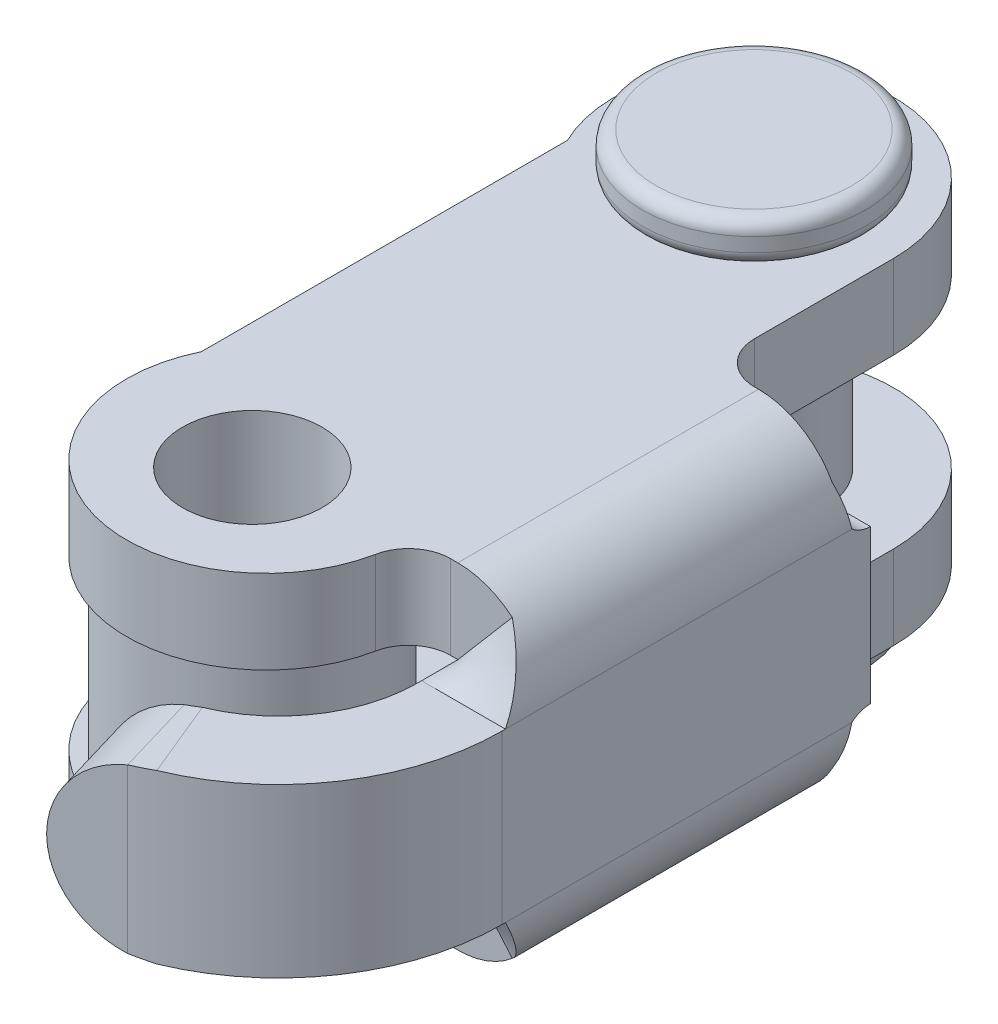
ISO-10303-21;
HEADER;
FILE_DESCRIPTION(('STEP AP214'),'2;1');
FILE_NAME('part.step','',(''),(''),'','','');
FILE_SCHEMA(('AUTOMOTIVE_DESIGN { 1 0 10303 214 1 1 1 1 }'));
ENDSEC;
DATA;
#1=APPLICATION_CONTEXT('core data for automotive mechanical design processes');
#2=APPLICATION_PROTOCOL_DEFINITION('international standard','automotive_design',2000,#1);
#3=PRODUCT_CONTEXT('',#1,'mechanical');
#4=PRODUCT('Part','Part','',(#3));
#5=PRODUCT_RELATED_PRODUCT_CATEGORY('part','',(#4));
#6=PRODUCT_DEFINITION_FORMATION('','',#4);
#7=PRODUCT_DEFINITION_CONTEXT('part definition',#1,'design');
#8=PRODUCT_DEFINITION('design','',#6,#7);
#9=PRODUCT_DEFINITION_SHAPE('','',#8);
#10=(LENGTH_UNIT() NAMED_UNIT(*) SI_UNIT(.MILLI.,.METRE.));
#11=(NAMED_UNIT(*) PLANE_ANGLE_UNIT() SI_UNIT($,.RADIAN.));
#12=(NAMED_UNIT(*) SI_UNIT($,.STERADIAN.) SOLID_ANGLE_UNIT());
#13=UNCERTAINTY_MEASURE_WITH_UNIT(LENGTH_MEASURE(1.E-05),#10,'distance_accuracy_value','');
#14=(GEOMETRIC_REPRESENTATION_CONTEXT(3) GLOBAL_UNCERTAINTY_ASSIGNED_CONTEXT((#13)) GLOBAL_UNIT_ASSIGNED_CONTEXT((#10,
#11,#12)) REPRESENTATION_CONTEXT('',''));
#15=CARTESIAN_POINT('',(0.,0.,0.));
#16=DIRECTION('',(0.,0.,1.));
#17=DIRECTION('',(1.,0.,0.));
#18=AXIS2_PLACEMENT_3D('',#15,#16,#17);
#19=CARTESIAN_POINT('',(0.,-7.504,0.));
#20=DIRECTION('',(0.,1.,0.));
#21=DIRECTION('',(0.,0.,1.));
#22=AXIS2_PLACEMENT_3D('',#19,#20,#21);
#23=PLANE('',#22);
#24=CARTESIAN_POINT('',(0.,-7.504,0.));
#25=DIRECTION('',(0.,1.,0.));
#26=DIRECTION('',(0.,0.,-1.));
#27=AXIS2_PLACEMENT_3D('',#24,#25,#26);
#28=CIRCLE('',#27,3.50000000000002);
#29=CARTESIAN_POINT('',(0.,-7.504,-3.5));
#30=VERTEX_POINT('',#29);
#31=CARTESIAN_POINT('',(0.,-7.504,3.5));
#32=VERTEX_POINT('',#31);
#33=EDGE_CURVE('E257',#30,#32,#28,.T.);
#34=ORIENTED_EDGE('',*,*,#33,.F.);
#35=CARTESIAN_POINT('',(0.,-7.504,0.));
#36=DIRECTION('',(0.,1.,0.));
#37=DIRECTION('',(0.,0.,1.));
#38=AXIS2_PLACEMENT_3D('',#35,#36,#37);
#39=CIRCLE('',#38,3.50000000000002);
#40=EDGE_CURVE('E887',#32,#30,#39,.T.);
#41=ORIENTED_EDGE('',*,*,#40,.F.);
#42=EDGE_LOOP('',(#34,#41));
#43=FACE_BOUND('',#42,.T.);
#44=ADVANCED_FACE('F14',(#43),#23,.F.);
#45=CARTESIAN_POINT('',(0.,-7.004,0.));
#46=DIRECTION('',(0.,1.,0.));
#47=DIRECTION('',(0.,0.,1.));
#48=AXIS2_PLACEMENT_3D('',#45,#46,#47);
#49=TOROIDAL_SURFACE('',#48,3.50000000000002,0.5);
#50=ORIENTED_EDGE('',*,*,#40,.T.);
#51=ORIENTED_EDGE('',*,*,#33,.T.);
#52=EDGE_LOOP('',(#50,#51));
#53=FACE_BOUND('',#52,.T.);
#54=CARTESIAN_POINT('',(0.,-7.004,0.));
#55=DIRECTION('',(0.,-1.,0.));
#56=DIRECTION('',(0.,0.,-1.));
#57=AXIS2_PLACEMENT_3D('',#54,#55,#56);
#58=CIRCLE('',#57,4.);
#59=CARTESIAN_POINT('',(0.,-7.004,-4.00000000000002));
#60=VERTEX_POINT('',#59);
#61=EDGE_CURVE('E288',#60,#60,#58,.F.);
#62=ORIENTED_EDGE('',*,*,#61,.F.);
#63=EDGE_LOOP('',(#62));
#64=FACE_BOUND('',#63,.T.);
#65=ADVANCED_FACE('F335',(#53,#64),#49,.T.);
#66=CARTESIAN_POINT('',(10.9856949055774,-5.62695571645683,21.1138912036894));
#67=DIRECTION('',(-0.284015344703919,0.,-0.958819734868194));
#68=DIRECTION('',(-0.958819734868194,0.,0.284015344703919));
#69=AXIS2_PLACEMENT_3D('',#66,#67,#68);
#70=PLANE('',#69);
#71=DIRECTION('',(0.,1.,0.));
#72=VECTOR('',#71,1.);
#73=CARTESIAN_POINT('',(3.06159904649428,-10.7017485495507,23.4611153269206));
#74=LINE('',#73,#72);
#75=CARTESIAN_POINT('',(3.06159904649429,2.9254976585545,23.4611153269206));
#76=VERTEX_POINT('',#75);
#77=CARTESIAN_POINT('',(3.06159904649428,-2.9254976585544,23.4611153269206));
#78=VERTEX_POINT('',#77);
#79=EDGE_CURVE('E271',#76,#78,#74,.F.);
#80=ORIENTED_EDGE('',*,*,#79,.T.);
#81=CARTESIAN_POINT('',(3.6986649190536,0.,23.2724078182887));
#82=DIRECTION('',(0.284015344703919,0.,0.958819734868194));
#83=DIRECTION('',(0.958819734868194,0.,-0.284015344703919));
#84=AXIS2_PLACEMENT_3D('',#81,#82,#83);
#85=CIRCLE('',#84,3.00000000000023);
#86=EDGE_CURVE('E246',#76,#78,#85,.T.);
#87=ORIENTED_EDGE('',*,*,#86,.F.);
#88=EDGE_LOOP('',(#80,#87));
#89=FACE_BOUND('',#88,.T.);
#90=ADVANCED_FACE('F277',(#89),#70,.T.);
#91=CARTESIAN_POINT('',(3.69866492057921,0.,23.2724078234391));
#92=DIRECTION('',(0.284015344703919,0.,0.958819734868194));
#93=DIRECTION('',(0.958819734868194,0.,-0.284015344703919));
#94=AXIS2_PLACEMENT_3D('',#91,#92,#93);
#95=CYLINDRICAL_SURFACE('',#94,3.00000000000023);
#96=CARTESIAN_POINT('',(4.55071095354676,0.,26.1488670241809));
#97=DIRECTION('',(0.284015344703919,0.,0.958819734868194));
#98=DIRECTION('',(0.958819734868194,0.,-0.284015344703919));
#99=AXIS2_PLACEMENT_3D('',#96,#97,#98);
#100=CIRCLE('',#99,3.00000000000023);
#101=CARTESIAN_POINT('',(3.91364508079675,-2.9254976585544,26.337574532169));
#102=VERTEX_POINT('',#101);
#103=CARTESIAN_POINT('',(3.91364508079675,2.92549765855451,26.337574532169));
#104=VERTEX_POINT('',#103);
#105=EDGE_CURVE('E688',#102,#104,#100,.F.);
#106=ORIENTED_EDGE('',*,*,#105,.T.);
#107=DIRECTION('',(-0.284015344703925,0.,-0.958819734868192));
#108=VECTOR('',#107,1.);
#109=CARTESIAN_POINT('',(3.48762206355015,2.92549765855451,24.8993449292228));
#110=LINE('',#109,#108);
#111=EDGE_CURVE('E254',#104,#76,#110,.T.);
#112=ORIENTED_EDGE('',*,*,#111,.T.);
#113=ORIENTED_EDGE('',*,*,#86,.T.);
#114=DIRECTION('',(0.284015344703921,0.,0.958819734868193));
#115=VECTOR('',#114,1.);
#116=CARTESIAN_POINT('',(3.48762206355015,-2.9254976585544,24.8993449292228));
#117=LINE('',#116,#115);
#118=EDGE_CURVE('E253',#78,#102,#117,.T.);
#119=ORIENTED_EDGE('',*,*,#118,.T.);
#120=EDGE_LOOP('',(#106,#112,#113,#119));
#121=FACE_BOUND('',#120,.T.);
#122=ADVANCED_FACE('F252',(#121),#95,.T.);
#123=CARTESIAN_POINT('',(4.68450122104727,-3.00000000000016,26.0656840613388));
#124=CARTESIAN_POINT('',(4.43240421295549,-2.97516580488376,26.1693683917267));
#125=CARTESIAN_POINT('',(4.1750062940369,-2.9503318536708,26.2601558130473));
#126=CARTESIAN_POINT('',(3.91364508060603,-2.9254976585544,26.3375745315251));
#127=CARTESIAN_POINT('',(3.54338413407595,-3.00000000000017,23.2911837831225));
#128=CARTESIAN_POINT('',(3.38582351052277,-2.97516580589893,23.3559864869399));
#129=CARTESIAN_POINT('',(3.22494979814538,-2.95033185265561,23.4127286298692));
#130=CARTESIAN_POINT('',(3.06159904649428,-2.9254976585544,23.4611153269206));
#131=B_SPLINE_SURFACE_WITH_KNOTS('',1,3,((#123,#124,#125,#126),(#127,#128,#129,#130)),
.UNSPECIFIED.,.F.,.F.,.F.,(2,2),(4,4),(0.,1.),(0.,1.),.UNSPECIFIED.);
#132=CARTESIAN_POINT('',(3.06159904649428,-2.92549765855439,23.4611153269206));
#133=CARTESIAN_POINT('',(3.08201782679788,-2.9286019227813,23.4550670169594));
#134=CARTESIAN_POINT('',(3.10239796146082,-2.9317061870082,23.448888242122));
#135=CARTESIAN_POINT('',(3.14307762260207,-2.93791471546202,23.4362708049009));
#136=CARTESIAN_POINT('',(3.16337714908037,-2.94101897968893,23.4298321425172));
#137=CARTESIAN_POINT('',(3.20389227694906,-2.94722750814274,23.4166959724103));
#138=CARTESIAN_POINT('',(3.22410787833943,-2.95033177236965,23.409998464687));
#139=CARTESIAN_POINT('',(3.26445185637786,-2.95654030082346,23.3963456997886));
#140=CARTESIAN_POINT('',(3.28458023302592,-2.95964456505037,23.3893904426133));
#141=CARTESIAN_POINT('',(3.32474647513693,-2.96585309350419,23.3752233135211));
#142=CARTESIAN_POINT('',(3.3447843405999,-2.96895735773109,23.3680114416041));
#143=CARTESIAN_POINT('',(3.38476628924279,-2.97516588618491,23.3533322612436));
#144=CARTESIAN_POINT('',(3.40471037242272,-2.97827015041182,23.3458649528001));
#145=CARTESIAN_POINT('',(3.44450149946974,-2.98447867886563,23.3306761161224));
#146=CARTESIAN_POINT('',(3.46434854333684,-2.98758294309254,23.3229545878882));
#147=CARTESIAN_POINT('',(3.50394235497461,-2.99379147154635,23.3072585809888));
#148=CARTESIAN_POINT('',(3.52368912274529,-2.99689573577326,23.2992841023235));
#149=CARTESIAN_POINT('',(3.54338413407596,-3.00000000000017,23.2911837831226));
#150=B_SPLINE_CURVE_WITH_KNOTS('',3,(#132,#133,#134,#135,#136,#137,#138,#139,#140,#141,#142,
#143,#144,#145,#146,#147,#148,#149),.UNSPECIFIED.,.F.,.F.,(4,2,2,2,2,2,2,2,4),(0.,
0.0645619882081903,0.129123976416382,0.193685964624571,0.258247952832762,0.322809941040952,
0.387371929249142,0.451933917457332,0.516495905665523),.UNSPECIFIED.);
#151=CARTESIAN_POINT('',(3.54338413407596,-3.00000000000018,23.2911837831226));
#152=VERTEX_POINT('',#151);
#153=EDGE_CURVE('E264',#78,#152,#150,.T.);
#154=DIRECTION('',(0.380372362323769,0.,0.924833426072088));
#155=VECTOR('',#154,1.);
#156=CARTESIAN_POINT('',(3.54338413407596,-3.00000000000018,23.2911837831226));
#157=LINE('',#156,#155);
#158=CARTESIAN_POINT('',(4.68450122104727,-3.00000000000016,26.0656840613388));
#159=VERTEX_POINT('',#158);
#160=EDGE_CURVE('E686',#152,#159,#157,.T.);
#161=CARTESIAN_POINT('',(3.91364508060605,-2.92549765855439,26.3375745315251));
#162=CARTESIAN_POINT('',(3.94631512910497,-2.9286019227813,26.3278972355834));
#163=CARTESIAN_POINT('',(3.97892334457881,-2.9317061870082,26.3180111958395));
#164=CARTESIAN_POINT('',(4.04401080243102,-2.93791471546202,26.2978232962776));
#165=CARTESIAN_POINT('',(4.0764900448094,-2.94101897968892,26.2875214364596));
#166=CARTESIAN_POINT('',(4.1413142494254,-2.94722750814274,26.2665035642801));
#167=CARTESIAN_POINT('',(4.17365921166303,-2.95033177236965,26.2557875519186));
#168=CARTESIAN_POINT('',(4.23820957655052,-2.95654030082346,26.2339431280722));
#169=CARTESIAN_POINT('',(4.27041497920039,-2.95964456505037,26.2228147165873));
#170=CARTESIAN_POINT('',(4.3346809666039,-2.96585309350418,26.2001473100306));
#171=CARTESIAN_POINT('',(4.36674155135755,-2.96895735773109,26.1886083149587));
#172=CARTESIAN_POINT('',(4.43071266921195,-2.9751658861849,26.1651216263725));
#173=CARTESIAN_POINT('',(4.4626232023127,-2.97827015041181,26.1531739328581));
#174=CARTESIAN_POINT('',(4.52628900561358,-2.98447867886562,26.1288717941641));
#175=CARTESIAN_POINT('',(4.55804427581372,-2.98758294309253,26.1165173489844));
#176=CARTESIAN_POINT('',(4.62139437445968,-2.99379147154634,26.0914037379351));
#177=CARTESIAN_POINT('',(4.65298920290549,-2.99689573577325,26.0786445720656));
#178=CARTESIAN_POINT('',(4.68450122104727,-3.00000000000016,26.0656840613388));
#179=B_SPLINE_CURVE_WITH_KNOTS('',3,(#161,#162,#163,#164,#165,#166,#167,#168,#169,#170,#171,
#172,#173,#174,#175,#176,#177,#178),.UNSPECIFIED.,.F.,.F.,(4,2,2,2,2,2,2,2,4),(0.,
0.102642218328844,0.205284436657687,0.307926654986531,0.410568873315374,0.513211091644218,
0.615853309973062,0.718495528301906,0.821137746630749),.UNSPECIFIED.);
#180=EDGE_CURVE('E256',#102,#159,#179,.T.);
#181=ORIENTED_EDGE('',*,*,#153,.T.);
#182=ORIENTED_EDGE('',*,*,#160,.T.);
#183=ORIENTED_EDGE('',*,*,#180,.F.);
#184=ORIENTED_EDGE('',*,*,#118,.F.);
#185=EDGE_LOOP('',(#181,#182,#183,#184));
#186=FACE_BOUND('',#185,.T.);
#187=ADVANCED_FACE('F262',(#186),#131,.F.);
#188=CARTESIAN_POINT('',(9.67152232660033,-3.00000000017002,6.13743782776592));
#189=CARTESIAN_POINT('',(9.67152232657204,-3.50498772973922,6.25044238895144));
#190=CARTESIAN_POINT('',(9.54355422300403,-4.007545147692,6.36299543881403));
#191=CARTESIAN_POINT('',(9.30203974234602,-4.45103512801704,6.47599999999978));
#192=CARTESIAN_POINT('',(9.64152232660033,-3.00000000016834,6.13743782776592));
#193=CARTESIAN_POINT('',(9.64152232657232,-3.49999443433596,6.2504408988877));
#194=CARTESIAN_POINT('',(9.51481955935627,-3.99758261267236,6.36299692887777));
#195=CARTESIAN_POINT('',(9.27569316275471,-4.4366873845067,6.47599999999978));
#196=CARTESIAN_POINT('',(6.64152232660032,-3.00000000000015,6.13743782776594));
#197=CARTESIAN_POINT('',(6.64152232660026,-3.00066489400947,6.25029189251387));
#198=CARTESIAN_POINT('',(6.6413531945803,-3.0013291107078,6.36314593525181));
#199=CARTESIAN_POINT('',(6.64103520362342,-3.00191303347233,6.47599999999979));
#200=B_SPLINE_SURFACE_WITH_KNOTS('',1,3,((#188,#189,#190,#191),(#192,#193,#194,#195),(#196,#197,
#198,#199)),.UNSPECIFIED.,.F.,.F.,.F.,(2,1,2),(4,4),(-0.01,0.,1.),(0.,1.),.UNSPECIFIED.);
#201=DIRECTION('',(1.,0.,0.));
#202=VECTOR('',#201,1.);
#203=CARTESIAN_POINT('',(6.64152232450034,-3.,6.13743782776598));
#204=LINE('',#203,#202);
#205=CARTESIAN_POINT('',(6.64152232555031,-2.99999999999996,6.13743782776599));
#206=VERTEX_POINT('',#205);
#207=CARTESIAN_POINT('',(9.64152232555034,-3.00000000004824,6.13743782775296));
#208=VERTEX_POINT('',#207);
#209=EDGE_CURVE('E725',#206,#208,#204,.T.);
#210=CARTESIAN_POINT('',(9.27569316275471,-4.4366873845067,6.47599999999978));
#211=CARTESIAN_POINT('',(9.30666051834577,-4.37982893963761,6.46136677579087));
#212=CARTESIAN_POINT('',(9.33578401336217,-4.3219669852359,6.44673284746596));
#213=CARTESIAN_POINT('',(9.3902342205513,-4.20448329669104,6.41746508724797));
#214=CARTESIAN_POINT('',(9.41556093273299,-4.14486156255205,6.40283125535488));
#215=CARTESIAN_POINT('',(9.46230851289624,-4.02410555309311,6.37356519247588));
#216=CARTESIAN_POINT('',(9.48372938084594,-3.96297127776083,6.35893296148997));
#217=CARTESIAN_POINT('',(9.52257641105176,-3.83944647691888,6.32966953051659));
#218=CARTESIAN_POINT('',(9.5400025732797,-3.77705595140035,6.31503833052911));
#219=CARTESIAN_POINT('',(9.57078750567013,-3.65127850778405,6.28577560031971));
#220=CARTESIAN_POINT('',(9.58414627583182,-3.5878915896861,6.27114407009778));
#221=CARTESIAN_POINT('',(9.60673888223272,-3.46039039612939,6.24188030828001));
#222=CARTESIAN_POINT('',(9.61597271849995,-3.39627612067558,6.22724807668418));
#223=CARTESIAN_POINT('',(9.6353770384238,-3.22176538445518,6.18756285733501));
#224=CARTESIAN_POINT('',(9.64153519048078,-3.11091167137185,6.16250646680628));
#225=CARTESIAN_POINT('',(9.64152232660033,-3.00000000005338,6.13743782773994));
#226=B_SPLINE_CURVE_WITH_KNOTS('',3,(#210,#211,#212,#213,#214,#215,#216,#217,#218,#219,#220,
#221,#222,#223,#224,#225),.UNSPECIFIED.,.F.,.F.,(4,2,2,2,2,2,2,4),(0.,0.199099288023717,
0.398198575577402,0.597297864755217,0.796397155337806,0.995496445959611,1.19459573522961,
1.53542415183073),.UNSPECIFIED.);
#227=CARTESIAN_POINT('',(9.2756931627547,-4.43668738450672,6.47599999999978));
#228=VERTEX_POINT('',#227);
#229=EDGE_CURVE('E267',#228,#208,#226,.T.);
#230=DIRECTION('',(-0.878219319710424,0.478258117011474,0.));
#231=VECTOR('',#230,1.);
#232=CARTESIAN_POINT('',(9.27569316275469,-4.43668738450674,6.47599999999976));
#233=LINE('',#232,#231);
#234=CARTESIAN_POINT('',(6.64103520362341,-3.00191303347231,6.47599999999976));
#235=VERTEX_POINT('',#234);
#236=EDGE_CURVE('E694',#228,#235,#233,.T.);
#237=CARTESIAN_POINT('',(6.64103520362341,-3.00191303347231,6.47599999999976));
#238=CARTESIAN_POINT('',(6.64107495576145,-3.00184004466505,6.46189324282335));
#239=CARTESIAN_POINT('',(6.64111242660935,-3.00176581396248,6.44778648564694));
#240=CARTESIAN_POINT('',(6.64118267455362,-3.00161516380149,6.41957297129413));
#241=CARTESIAN_POINT('',(6.64121545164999,-3.00153874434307,6.40546621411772));
#242=CARTESIAN_POINT('',(6.64127618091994,-3.00138401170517,6.37725269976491));
#243=CARTESIAN_POINT('',(6.64130413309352,-3.00130569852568,6.3631459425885));
#244=CARTESIAN_POINT('',(6.64135510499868,-3.00114748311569,6.33493242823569));
#245=CARTESIAN_POINT('',(6.64137812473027,-3.00106758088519,6.32082567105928));
#246=CARTESIAN_POINT('',(6.64141914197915,-3.00090649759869,6.29261215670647));
#247=CARTESIAN_POINT('',(6.64143713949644,-3.00082531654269,6.27850539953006));
#248=CARTESIAN_POINT('',(6.64146804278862,-3.00066199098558,6.25029188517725));
#249=CARTESIAN_POINT('',(6.64148094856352,-3.00057984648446,6.23618512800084));
#250=CARTESIAN_POINT('',(6.64150161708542,-3.00041491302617,6.20797161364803));
#251=CARTESIAN_POINT('',(6.64150937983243,-3.000332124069,6.19386485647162));
#252=CARTESIAN_POINT('',(6.64151973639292,-3.00016622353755,6.16565134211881));
#253=CARTESIAN_POINT('',(6.6415223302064,-3.00008311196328,6.1515445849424));
#254=CARTESIAN_POINT('',(6.6415223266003,-2.99999999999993,6.137437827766));
#255=B_SPLINE_CURVE_WITH_KNOTS('',3,(#237,#238,#239,#240,#241,#242,#243,#244,#245,#246,#247,
#248,#249,#250,#251,#252,#253,#254),.UNSPECIFIED.,.F.,.F.,(4,2,2,2,2,2,2,2,4),(0.,
0.0423210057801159,0.084642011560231,0.126963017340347,0.169284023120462,0.211605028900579,
0.253926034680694,0.296247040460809,0.338568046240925),.UNSPECIFIED.);
#256=EDGE_CURVE('E742',#235,#206,#255,.T.);
#257=ORIENTED_EDGE('',*,*,#209,.T.);
#258=ORIENTED_EDGE('',*,*,#229,.F.);
#259=ORIENTED_EDGE('',*,*,#236,.T.);
#260=ORIENTED_EDGE('',*,*,#256,.T.);
#261=EDGE_LOOP('',(#257,#258,#259,#260));
#262=FACE_BOUND('',#261,.T.);
#263=ADVANCED_FACE('F755',(#262),#200,.F.);
#264=CARTESIAN_POINT('',(6.63752232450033,-2.99999999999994,-0.638780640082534));
#265=DIRECTION('',(0.,0.,1.));
#266=DIRECTION('',(1.,0.,0.));
#267=AXIS2_PLACEMENT_3D('',#264,#265,#266);
#268=CYLINDRICAL_SURFACE('',#267,0.00400000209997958);
#269=DIRECTION('',(0.,0.,1.));
#270=VECTOR('',#269,1.);
#271=CARTESIAN_POINT('',(6.63752232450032,-3.00399999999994,18.7409));
#272=LINE('',#271,#270);
#273=CARTESIAN_POINT('',(6.63752232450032,-3.00399999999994,17.2409));
#274=VERTEX_POINT('',#273);
#275=CARTESIAN_POINT('',(6.63752232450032,-3.00399999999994,6.47599999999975));
#276=VERTEX_POINT('',#275);
#277=EDGE_CURVE('E675',#274,#276,#272,.F.);
#278=ORIENTED_EDGE('',*,*,#277,.F.);
#279=CARTESIAN_POINT('',(6.63752232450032,-2.99999999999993,17.2409));
#280=DIRECTION('',(0.,0.,1.));
#281=DIRECTION('',(1.,0.,0.));
#282=AXIS2_PLACEMENT_3D('',#279,#280,#281);
#283=CIRCLE('',#282,0.00400000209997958);
#284=CARTESIAN_POINT('',(6.6401188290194,-3.00304272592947,17.2409));
#285=VERTEX_POINT('',#284);
#286=EDGE_CURVE('E702',#274,#285,#283,.T.);
#287=ORIENTED_EDGE('',*,*,#286,.T.);
#288=CARTESIAN_POINT('',(6.6415223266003,-2.99999999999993,18.5408999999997));
#289=CARTESIAN_POINT('',(6.64152235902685,-3.00014406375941,18.4867333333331));
#290=CARTESIAN_POINT('',(6.64151454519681,-3.00028812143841,18.4325666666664));
#291=CARTESIAN_POINT('',(6.64148345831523,-3.00057455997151,18.3242333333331));
#292=CARTESIAN_POINT('',(6.64146018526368,-3.0007169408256,18.2700666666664));
#293=CARTESIAN_POINT('',(6.64139841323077,-3.00099836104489,18.1617333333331));
#294=CARTESIAN_POINT('',(6.6413599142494,-3.00113740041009,18.1075666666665));
#295=CARTESIAN_POINT('',(6.64126814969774,-3.00141051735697,17.9992333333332));
#296=CARTESIAN_POINT('',(6.64121488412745,-3.00154459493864,17.9450666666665));
#297=CARTESIAN_POINT('',(6.64109420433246,-3.00180622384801,17.8367333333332));
#298=CARTESIAN_POINT('',(6.64102679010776,-3.00193377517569,17.7825666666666));
#299=CARTESIAN_POINT('',(6.64087860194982,-3.00218086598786,17.6742333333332));
#300=CARTESIAN_POINT('',(6.64079782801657,-3.00230040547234,17.6200666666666));
#301=CARTESIAN_POINT('',(6.64062385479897,-3.00253007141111,17.5117333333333));
#302=CARTESIAN_POINT('',(6.64053065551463,-3.00264019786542,17.4575666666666));
#303=CARTESIAN_POINT('',(6.64033294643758,-3.00284977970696,17.3492333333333));
#304=CARTESIAN_POINT('',(6.64022843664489,-3.0029492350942,17.2950666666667));
#305=CARTESIAN_POINT('',(6.64011882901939,-3.00304272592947,17.2409));
#306=B_SPLINE_CURVE_WITH_KNOTS('',3,(#288,#289,#290,#291,#292,#293,#294,#295,#296,#297,#298,
#299,#300,#301,#302,#303,#304,#305),.UNSPECIFIED.,.F.,.F.,(4,2,2,2,2,2,2,2,4),(0.,
0.162500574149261,0.325001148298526,0.487501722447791,0.650002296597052,0.812502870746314,
0.975003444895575,1.13750401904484,1.3000045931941),.UNSPECIFIED.);
#307=CARTESIAN_POINT('',(6.6415223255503,-3.,18.5409));
#308=VERTEX_POINT('',#307);
#309=EDGE_CURVE('E693',#285,#308,#306,.F.);
#310=ORIENTED_EDGE('',*,*,#309,.T.);
#311=DIRECTION('',(0.,0.,1.));
#312=VECTOR('',#311,1.);
#313=CARTESIAN_POINT('',(6.6415223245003,-3.,18.7409));
#314=LINE('',#313,#312);
#315=EDGE_CURVE('E738',#206,#308,#314,.T.);
#316=ORIENTED_EDGE('',*,*,#315,.F.);
#317=ORIENTED_EDGE('',*,*,#256,.F.);
#318=CARTESIAN_POINT('',(6.63752232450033,-2.99999999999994,6.47599999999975));
#319=DIRECTION('',(0.,0.,1.));
#320=DIRECTION('',(1.,0.,0.));
#321=AXIS2_PLACEMENT_3D('',#318,#319,#320);
#322=CIRCLE('',#321,0.00400000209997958);
#323=EDGE_CURVE('E699',#235,#276,#322,.F.);
#324=ORIENTED_EDGE('',*,*,#323,.T.);
#325=EDGE_LOOP('',(#278,#287,#310,#316,#317,#324));
#326=FACE_BOUND('',#325,.T.);
#327=ADVANCED_FACE('F745',(#326),#268,.F.);
#328=CARTESIAN_POINT('',(0.,7.504,0.));
#329=DIRECTION('',(0.,-1.,0.));
#330=DIRECTION('',(0.,0.,-1.));
#331=AXIS2_PLACEMENT_3D('',#328,#329,#330);
#332=PLANE('',#331);
#333=CARTESIAN_POINT('',(0.,7.504,0.));
#334=DIRECTION('',(0.,-1.,0.));
#335=DIRECTION('',(0.,0.,1.));
#336=AXIS2_PLACEMENT_3D('',#333,#334,#335);
#337=CIRCLE('',#336,3.49999999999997);
#338=CARTESIAN_POINT('',(0.,7.504,3.5));
#339=VERTEX_POINT('',#338);
#340=CARTESIAN_POINT('',(0.,7.504,-3.5));
#341=VERTEX_POINT('',#340);
#342=EDGE_CURVE('E994',#339,#341,#337,.T.);
#343=ORIENTED_EDGE('',*,*,#342,.F.);
#344=CARTESIAN_POINT('',(0.,7.504,0.));
#345=DIRECTION('',(0.,-1.,0.));
#346=DIRECTION('',(0.,0.,-1.));
#347=AXIS2_PLACEMENT_3D('',#344,#345,#346);
#348=CIRCLE('',#347,3.49999999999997);
#349=EDGE_CURVE('E672',#341,#339,#348,.T.);
#350=ORIENTED_EDGE('',*,*,#349,.F.);
#351=EDGE_LOOP('',(#343,#350));
#352=FACE_BOUND('',#351,.T.);
#353=ADVANCED_FACE('F754',(#352),#332,.F.);
#354=CARTESIAN_POINT('',(0.,-6.004,0.));
#355=DIRECTION('',(0.,-1.,0.));
#356=DIRECTION('',(0.,0.,-1.));
#357=AXIS2_PLACEMENT_3D('',#354,#355,#356);
#358=CYLINDRICAL_SURFACE('',#357,4.);
#359=CARTESIAN_POINT('',(0.,-6.504,0.));
#360=DIRECTION('',(0.,1.,0.));
#361=DIRECTION('',(0.,0.,1.));
#362=AXIS2_PLACEMENT_3D('',#359,#360,#361);
#363=CIRCLE('',#362,4.);
#364=CARTESIAN_POINT('',(0.,-6.504,3.99999999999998));
#365=VERTEX_POINT('',#364);
#366=EDGE_CURVE('E989',#365,#365,#363,.T.);
#367=ORIENTED_EDGE('',*,*,#366,.F.);
#368=EDGE_LOOP('',(#367));
#369=FACE_BOUND('',#368,.T.);
#370=ORIENTED_EDGE('',*,*,#61,.T.);
#371=EDGE_LOOP('',(#370));
#372=FACE_BOUND('',#371,.T.);
#373=ADVANCED_FACE('F720',(#369,#372),#358,.T.);
#374=CARTESIAN_POINT('',(3.91364508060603,2.92549765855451,26.3375745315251));
#375=CARTESIAN_POINT('',(4.17500629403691,2.9503318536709,26.2601558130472));
#376=CARTESIAN_POINT('',(4.43240421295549,2.97516580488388,26.1693683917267));
#377=CARTESIAN_POINT('',(4.68450122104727,3.00000000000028,26.0656840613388));
#378=CARTESIAN_POINT('',(3.06159904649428,2.92549765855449,23.4611153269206));
#379=CARTESIAN_POINT('',(3.22494979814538,2.95033185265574,23.4127286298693));
#380=CARTESIAN_POINT('',(3.38582351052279,2.97516580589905,23.3559864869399));
#381=CARTESIAN_POINT('',(3.54338413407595,3.00000000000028,23.2911837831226));
#382=B_SPLINE_SURFACE_WITH_KNOTS('',1,3,((#374,#375,#376,#377),(#378,#379,#380,#381)),
.UNSPECIFIED.,.F.,.F.,.F.,(2,2),(4,4),(0.,1.),(0.,1.),.UNSPECIFIED.);
#383=CARTESIAN_POINT('',(3.54338413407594,3.00000000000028,23.2911837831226));
#384=CARTESIAN_POINT('',(3.52368912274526,2.99689573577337,23.2992841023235));
#385=CARTESIAN_POINT('',(3.50394235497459,2.99379147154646,23.3072585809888));
#386=CARTESIAN_POINT('',(3.46434854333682,2.98758294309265,23.3229545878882));
#387=CARTESIAN_POINT('',(3.44450149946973,2.98447867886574,23.3306761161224));
#388=CARTESIAN_POINT('',(3.4047103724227,2.97827015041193,23.3458649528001));
#389=CARTESIAN_POINT('',(3.38476628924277,2.97516588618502,23.3533322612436));
#390=CARTESIAN_POINT('',(3.34478434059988,2.9689573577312,23.3680114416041));
#391=CARTESIAN_POINT('',(3.32474647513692,2.9658530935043,23.3752233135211));
#392=CARTESIAN_POINT('',(3.28458023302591,2.95964456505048,23.3893904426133));
#393=CARTESIAN_POINT('',(3.26445185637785,2.95654030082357,23.3963456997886));
#394=CARTESIAN_POINT('',(3.22410787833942,2.95033177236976,23.409998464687));
#395=CARTESIAN_POINT('',(3.20389227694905,2.94722750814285,23.4166959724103));
#396=CARTESIAN_POINT('',(3.16337714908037,2.94101897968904,23.4298321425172));
#397=CARTESIAN_POINT('',(3.14307762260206,2.93791471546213,23.4362708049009));
#398=CARTESIAN_POINT('',(3.10239796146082,2.93170618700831,23.448888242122));
#399=CARTESIAN_POINT('',(3.08201782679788,2.92860192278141,23.4550670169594));
#400=CARTESIAN_POINT('',(3.06159904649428,2.9254976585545,23.4611153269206));
#401=B_SPLINE_CURVE_WITH_KNOTS('',3,(#383,#384,#385,#386,#387,#388,#389,#390,#391,#392,#393,
#394,#395,#396,#397,#398,#399,#400),.UNSPECIFIED.,.F.,.F.,(4,2,2,2,2,2,2,2,4),(0.,
0.064561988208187,0.129123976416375,0.193685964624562,0.258247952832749,0.322809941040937,
0.387371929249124,0.451933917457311,0.516495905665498),.UNSPECIFIED.);
#402=CARTESIAN_POINT('',(3.54338413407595,3.00000000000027,23.2911837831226));
#403=VERTEX_POINT('',#402);
#404=EDGE_CURVE('E278',#403,#76,#401,.T.);
#405=CARTESIAN_POINT('',(4.68450122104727,3.00000000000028,26.0656840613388));
#406=CARTESIAN_POINT('',(4.65298920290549,2.99689573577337,26.0786445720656));
#407=CARTESIAN_POINT('',(4.62139437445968,2.99379147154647,26.0914037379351));
#408=CARTESIAN_POINT('',(4.55804427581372,2.98758294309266,26.1165173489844));
#409=CARTESIAN_POINT('',(4.52628900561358,2.98447867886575,26.1288717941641));
#410=CARTESIAN_POINT('',(4.46262320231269,2.97827015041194,26.1531739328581));
#411=CARTESIAN_POINT('',(4.43071266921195,2.97516588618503,26.1651216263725));
#412=CARTESIAN_POINT('',(4.36674155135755,2.96895735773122,26.1886083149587));
#413=CARTESIAN_POINT('',(4.3346809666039,2.96585309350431,26.2001473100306));
#414=CARTESIAN_POINT('',(4.27041497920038,2.9596445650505,26.2228147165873));
#415=CARTESIAN_POINT('',(4.23820957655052,2.95654030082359,26.2339431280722));
#416=CARTESIAN_POINT('',(4.17365921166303,2.95033177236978,26.2557875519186));
#417=CARTESIAN_POINT('',(4.1413142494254,2.94722750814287,26.2665035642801));
#418=CARTESIAN_POINT('',(4.0764900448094,2.94101897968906,26.2875214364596));
#419=CARTESIAN_POINT('',(4.04401080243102,2.93791471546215,26.2978232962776));
#420=CARTESIAN_POINT('',(3.97892334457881,2.93170618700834,26.3180111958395));
#421=CARTESIAN_POINT('',(3.94631512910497,2.92860192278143,26.3278972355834));
#422=CARTESIAN_POINT('',(3.91364508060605,2.92549765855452,26.3375745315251));
#423=B_SPLINE_CURVE_WITH_KNOTS('',3,(#405,#406,#407,#408,#409,#410,#411,#412,#413,#414,#415,
#416,#417,#418,#419,#420,#421,#422),.UNSPECIFIED.,.F.,.F.,(4,2,2,2,2,2,2,2,4),(0.,
0.102642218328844,0.205284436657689,0.307926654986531,0.410568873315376,0.513211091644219,
0.615853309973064,0.718495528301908,0.821137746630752),.UNSPECIFIED.);
#424=CARTESIAN_POINT('',(4.68450122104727,3.00000000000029,26.0656840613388));
#425=VERTEX_POINT('',#424);
#426=EDGE_CURVE('E283',#425,#104,#423,.T.);
#427=DIRECTION('',(-0.380372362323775,0.,-0.924833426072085));
#428=VECTOR('',#427,1.);
#429=CARTESIAN_POINT('',(4.68450122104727,3.00000000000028,26.0656840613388));
#430=LINE('',#429,#428);
#431=EDGE_CURVE('E484',#425,#403,#430,.T.);
#432=ORIENTED_EDGE('',*,*,#404,.T.);
#433=ORIENTED_EDGE('',*,*,#111,.F.);
#434=ORIENTED_EDGE('',*,*,#426,.F.);
#435=ORIENTED_EDGE('',*,*,#431,.T.);
#436=EDGE_LOOP('',(#432,#433,#434,#435));
#437=FACE_BOUND('',#436,.T.);
#438=ADVANCED_FACE('F443',(#437),#382,.F.);
#439=CARTESIAN_POINT('',(1.64152232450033,-10.7017485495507,18.66701665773));
#440=DIRECTION('',(0.,1.,0.));
#441=DIRECTION('',(0.,0.,1.));
#442=AXIS2_PLACEMENT_3D('',#439,#440,#441);
#443=CYLINDRICAL_SURFACE('',#442,4.99999999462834);
#444=ORIENTED_EDGE('',*,*,#79,.F.);
#445=ORIENTED_EDGE('',*,*,#404,.F.);
#446=CARTESIAN_POINT('',(1.64152232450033,3.00000000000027,18.66701665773));
#447=DIRECTION('',(0.,1.,0.));
#448=DIRECTION('',(0.,0.,1.));
#449=AXIS2_PLACEMENT_3D('',#446,#447,#448);
#450=CIRCLE('',#449,4.99999999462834);
#451=CARTESIAN_POINT('',(6.64152232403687,3.00000000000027,18.66701665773));
#452=VERTEX_POINT('',#451);
#453=EDGE_CURVE('E416',#403,#452,#450,.T.);
#454=ORIENTED_EDGE('',*,*,#453,.T.);
#455=DIRECTION('',(0.,1.,0.));
#456=VECTOR('',#455,1.);
#457=CARTESIAN_POINT('',(6.6415223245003,-5.62695571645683,18.66701665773));
#458=LINE('',#457,#456);
#459=CARTESIAN_POINT('',(6.6415223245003,-3.00000000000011,18.66701665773));
#460=VERTEX_POINT('',#459);
#461=EDGE_CURVE('E703',#460,#452,#458,.T.);
#462=ORIENTED_EDGE('',*,*,#461,.F.);
#463=CARTESIAN_POINT('',(1.64152232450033,-3.00000000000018,18.66701665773));
#464=DIRECTION('',(0.,1.,0.));
#465=DIRECTION('',(0.,0.,1.));
#466=AXIS2_PLACEMENT_3D('',#463,#464,#465);
#467=CIRCLE('',#466,4.99999999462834);
#468=EDGE_CURVE('E274',#460,#152,#467,.F.);
#469=ORIENTED_EDGE('',*,*,#468,.T.);
#470=ORIENTED_EDGE('',*,*,#153,.F.);
#471=EDGE_LOOP('',(#444,#445,#454,#462,#469,#470));
#472=FACE_BOUND('',#471,.T.);
#473=ADVANCED_FACE('F270',(#472),#443,.F.);
#474=CARTESIAN_POINT('',(7.69999999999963,-3.00399999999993,17.2408999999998));
#475=DIRECTION('',(0.,0.,-1.));
#476=DIRECTION('',(-1.,0.,0.));
#477=AXIS2_PLACEMENT_3D('',#474,#475,#476);
#478=PLANE('',#477);
#479=ORIENTED_EDGE('',*,*,#286,.F.);
#480=DIRECTION('',(-1.,0.,0.));
#481=VECTOR('',#480,1.);
#482=CARTESIAN_POINT('',(6.37304428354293,-3.00399999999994,17.2409));
#483=LINE('',#482,#481);
#484=CARTESIAN_POINT('',(6.37304428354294,-3.00399999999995,17.2409));
#485=VERTEX_POINT('',#484);
#486=EDGE_CURVE('E669',#485,#274,#483,.F.);
#487=ORIENTED_EDGE('',*,*,#486,.F.);
#488=DIRECTION('',(0.,-1.,0.));
#489=VECTOR('',#488,1.);
#490=CARTESIAN_POINT('',(6.37304428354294,-3.00399999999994,17.2409));
#491=LINE('',#490,#489);
#492=CARTESIAN_POINT('',(6.37304428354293,-6.00399999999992,17.2409));
#493=VERTEX_POINT('',#492);
#494=EDGE_CURVE('E952',#485,#493,#491,.T.);
#495=ORIENTED_EDGE('',*,*,#494,.T.);
#496=DIRECTION('',(-1.,0.,0.));
#497=VECTOR('',#496,1.);
#498=CARTESIAN_POINT('',(7.69999999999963,-6.00399999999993,17.2408999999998));
#499=LINE('',#498,#497);
#500=CARTESIAN_POINT('',(6.63752232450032,-6.00399999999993,17.2409));
#501=VERTEX_POINT('',#500);
#502=EDGE_CURVE('E275',#501,#493,#499,.T.);
#503=ORIENTED_EDGE('',*,*,#502,.F.);
#504=CARTESIAN_POINT('',(6.63752232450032,-2.99999999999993,17.2409));
#505=DIRECTION('',(0.,0.,1.));
#506=DIRECTION('',(1.,0.,0.));
#507=AXIS2_PLACEMENT_3D('',#504,#505,#506);
#508=CIRCLE('',#507,3.00400000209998);
#509=CARTESIAN_POINT('',(8.58749619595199,-5.28508597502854,17.2409));
#510=VERTEX_POINT('',#509);
#511=EDGE_CURVE('E465',#510,#501,#508,.F.);
#512=ORIENTED_EDGE('',*,*,#511,.F.);
#513=DIRECTION('',(-0.649125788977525,0.760681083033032,-1.15648231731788E-13));
#514=VECTOR('',#513,1.);
#515=CARTESIAN_POINT('',(7.62354439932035,-4.1554745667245,17.2409));
#516=LINE('',#515,#514);
#517=EDGE_CURVE('E690',#510,#285,#516,.T.);
#518=ORIENTED_EDGE('',*,*,#517,.T.);
#519=EDGE_LOOP('',(#479,#487,#495,#503,#512,#518));
#520=FACE_BOUND('',#519,.T.);
#521=ADVANCED_FACE('F718',(#520),#478,.F.);
#522=CARTESIAN_POINT('',(8.24999999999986,-3.00399999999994,6.47599999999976));
#523=DIRECTION('',(0.,0.,1.));
#524=DIRECTION('',(1.,0.,0.));
#525=AXIS2_PLACEMENT_3D('',#522,#523,#524);
#526=PLANE('',#525);
#527=CARTESIAN_POINT('',(6.63752232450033,-2.99999999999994,6.47599999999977));
#528=DIRECTION('',(0.,0.,1.));
#529=DIRECTION('',(1.,0.,0.));
#530=AXIS2_PLACEMENT_3D('',#527,#528,#529);
#531=CIRCLE('',#530,3.00400000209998);
#532=CARTESIAN_POINT('',(6.63752232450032,-6.004,6.47599999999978));
#533=VERTEX_POINT('',#532);
#534=EDGE_CURVE('E461',#533,#228,#531,.T.);
#535=ORIENTED_EDGE('',*,*,#534,.F.);
#536=DIRECTION('',(1.,0.,0.));
#537=VECTOR('',#536,1.);
#538=CARTESIAN_POINT('',(8.24999999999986,-6.004,6.47599999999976));
#539=LINE('',#538,#537);
#540=CARTESIAN_POINT('',(6.49999999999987,-6.004,6.47599999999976));
#541=VERTEX_POINT('',#540);
#542=EDGE_CURVE('E697',#541,#533,#539,.T.);
#543=ORIENTED_EDGE('',*,*,#542,.F.);
#544=DIRECTION('',(0.,-1.,0.));
#545=VECTOR('',#544,1.);
#546=CARTESIAN_POINT('',(6.49999999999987,-3.00399999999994,6.47599999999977));
#547=LINE('',#546,#545);
#548=CARTESIAN_POINT('',(6.49999999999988,-3.00399999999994,6.47599999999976));
#549=VERTEX_POINT('',#548);
#550=EDGE_CURVE('E961',#541,#549,#547,.F.);
#551=ORIENTED_EDGE('',*,*,#550,.T.);
#552=DIRECTION('',(-1.,0.,0.));
#553=VECTOR('',#552,1.);
#554=CARTESIAN_POINT('',(6.37304428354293,-3.00399999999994,6.47599999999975));
#555=LINE('',#554,#553);
#556=EDGE_CURVE('E673',#276,#549,#555,.T.);
#557=ORIENTED_EDGE('',*,*,#556,.F.);
#558=ORIENTED_EDGE('',*,*,#323,.F.);
#559=ORIENTED_EDGE('',*,*,#236,.F.);
#560=EDGE_LOOP('',(#535,#543,#551,#557,#558,#559));
#561=FACE_BOUND('',#560,.T.);
#562=ADVANCED_FACE('F441',(#561),#526,.F.);
#563=CARTESIAN_POINT('',(8.60696996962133,-5.30790640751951,17.2409));
#564=CARTESIAN_POINT('',(8.93951780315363,-5.02412733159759,17.4576128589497));
#565=CARTESIAN_POINT('',(9.20948811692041,-4.66768880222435,17.6742333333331));
#566=CARTESIAN_POINT('',(9.57563097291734,-3.87390591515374,18.1075666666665));
#567=CARTESIAN_POINT('',(9.6715223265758,-3.43717116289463,18.3241871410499));
#568=CARTESIAN_POINT('',(9.67152232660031,-3.00000000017,18.5409));
#569=CARTESIAN_POINT('',(8.587496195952,-5.28508597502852,17.2409));
#570=CARTESIAN_POINT('',(8.91675581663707,-5.00411288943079,17.4576124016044));
#571=CARTESIAN_POINT('',(9.18405668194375,-4.65119880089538,17.6742333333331));
#572=CARTESIAN_POINT('',(9.54657914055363,-3.86526478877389,18.1075666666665));
#573=CARTESIAN_POINT('',(9.64152232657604,-3.43284844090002,18.3241875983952));
#574=CARTESIAN_POINT('',(9.64152232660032,-3.00000000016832,18.5409));
#575=CARTESIAN_POINT('',(6.64011882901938,-3.00304272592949,17.2408999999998));
#576=CARTESIAN_POINT('',(6.6405571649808,-3.0026686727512,17.457566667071));
#577=CARTESIAN_POINT('',(6.6409131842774,-3.00219866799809,17.6742333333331));
#578=CARTESIAN_POINT('',(6.64139590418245,-3.00115215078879,18.1075666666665));
#579=CARTESIAN_POINT('',(6.64152232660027,-3.0005762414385,18.3242333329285));
#580=CARTESIAN_POINT('',(6.6415223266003,-3.00000000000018,18.5408999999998));
#581=B_SPLINE_SURFACE_WITH_KNOTS('',1,3,((#563,#564,#565,#566,#567,#568),(#569,#570,#571,#572,
#573,#574),(#575,#576,#577,#578,#579,#580)),.UNSPECIFIED.,.F.,.F.,.F.,(2,1,2),(4,2,4),(-0.01,0.,
1.),(0.,0.5,1.),.UNSPECIFIED.);
#582=CARTESIAN_POINT('',(9.64152232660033,-3.0000000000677,18.5409000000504));
#583=CARTESIAN_POINT('',(9.64153025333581,-3.08223751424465,18.4997246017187));
#584=CARTESIAN_POINT('',(9.63814559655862,-3.16447343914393,18.4585494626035));
#585=CARTESIAN_POINT('',(9.62464733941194,-3.32841041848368,18.3761916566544));
#586=CARTESIAN_POINT('',(9.61453225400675,-3.41011135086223,18.3350089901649));
#587=CARTESIAN_POINT('',(9.58768047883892,-3.5721017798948,18.2528026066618));
#588=CARTESIAN_POINT('',(9.5709690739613,-3.65239545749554,18.2117788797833));
#589=CARTESIAN_POINT('',(9.53104721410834,-3.81132089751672,18.1297435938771));
#590=CARTESIAN_POINT('',(9.50783855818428,-3.88995311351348,18.0887320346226));
#591=CARTESIAN_POINT('',(9.4515533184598,-4.0553947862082,18.0012371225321));
#592=CARTESIAN_POINT('',(9.41757453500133,-4.1418998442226,17.9547519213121));
#593=CARTESIAN_POINT('',(9.36073894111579,-4.2689604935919,17.885060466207));
#594=CARTESIAN_POINT('',(9.34082320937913,-4.31085147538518,17.861843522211));
#595=CARTESIAN_POINT('',(9.29907308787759,-4.39366897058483,17.8154069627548));
#596=CARTESIAN_POINT('',(9.27723869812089,-4.43459548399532,17.7921873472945));
#597=CARTESIAN_POINT('',(9.23169787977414,-4.51539423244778,17.7457490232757));
#598=CARTESIAN_POINT('',(9.20799145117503,-4.55526646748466,17.7225303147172));
#599=CARTESIAN_POINT('',(9.15876061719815,-4.63386814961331,17.6760959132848));
#600=CARTESIAN_POINT('',(9.13323621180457,-4.67259759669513,17.652880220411));
#601=CARTESIAN_POINT('',(9.05396394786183,-4.78701827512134,17.5831922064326));
#602=CARTESIAN_POINT('',(8.99754652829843,-4.86088953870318,17.5367088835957));
#603=CARTESIAN_POINT('',(8.90802494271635,-4.96748279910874,17.4670202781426));
#604=CARTESIAN_POINT('',(8.87737917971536,-5.00230105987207,17.4438042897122));
#605=CARTESIAN_POINT('',(8.81450715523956,-5.07048343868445,17.397369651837));
#606=CARTESIAN_POINT('',(8.78228089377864,-5.10384755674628,17.3741510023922));
#607=CARTESIAN_POINT('',(8.69720506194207,-5.18794260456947,17.3142566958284));
#608=CARTESIAN_POINT('',(8.64322571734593,-5.23753427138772,17.2775793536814));
#609=CARTESIAN_POINT('',(8.587496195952,-5.28508597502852,17.2409));
#610=B_SPLINE_CURVE_WITH_KNOTS('',3,(#582,#583,#584,#585,#586,#587,#588,#589,#590,#591,#592,
#593,#594,#595,#596,#597,#598,#599,#600,#601,#602,#603,#604,#605,#606,#607,#608,#609),
.UNSPECIFIED.,.F.,.F.,(4,2,2,2,2,2,2,2,2,2,2,2,2,4),(0.,0.275844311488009,0.551749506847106,
0.826607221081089,1.1013889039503,1.41273911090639,1.5683138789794,1.7238886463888,
1.87946341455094,2.03503818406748,2.34638841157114,2.50196318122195,2.65753794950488,
2.90326087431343),.UNSPECIFIED.);
#611=CARTESIAN_POINT('',(9.64152232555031,-3.0000000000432,18.5409));
#612=VERTEX_POINT('',#611);
#613=EDGE_CURVE('E452',#612,#510,#610,.T.);
#614=DIRECTION('',(1.,0.,0.));
#615=VECTOR('',#614,1.);
#616=CARTESIAN_POINT('',(1.64152232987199,-3.00000000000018,18.5409));
#617=LINE('',#616,#615);
#618=EDGE_CURVE('E685',#612,#308,#617,.F.);
#619=ORIENTED_EDGE('',*,*,#309,.F.);
#620=ORIENTED_EDGE('',*,*,#517,.F.);
#621=ORIENTED_EDGE('',*,*,#613,.F.);
#622=ORIENTED_EDGE('',*,*,#618,.T.);
#623=EDGE_LOOP('',(#619,#620,#621,#622));
#624=FACE_BOUND('',#623,.T.);
#625=ADVANCED_FACE('F429',(#624),#581,.F.);
#626=CARTESIAN_POINT('',(11.8377409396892,-5.62695571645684,23.9903504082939));
#627=DIRECTION('',(-0.284015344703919,0.,-0.958819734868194));
#628=DIRECTION('',(-0.958819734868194,0.,0.284015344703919));
#629=AXIS2_PLACEMENT_3D('',#626,#627,#628);
#630=PLANE('',#629);
#631=DIRECTION('',(0.,1.,0.));
#632=VECTOR('',#631,1.);
#633=CARTESIAN_POINT('',(3.91364508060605,-10.7017485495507,26.3375745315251));
#634=LINE('',#633,#632);
#635=EDGE_CURVE('E460',#104,#102,#634,.F.);
#636=ORIENTED_EDGE('',*,*,#635,.F.);
#637=ORIENTED_EDGE('',*,*,#105,.F.);
#638=EDGE_LOOP('',(#636,#637));
#639=FACE_BOUND('',#638,.T.);
#640=ADVANCED_FACE('F440',(#639),#630,.F.);
#641=CARTESIAN_POINT('',(1.64152232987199,-3.00000000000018,18.66701665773));
#642=DIRECTION('',(0.,1.,0.));
#643=DIRECTION('',(0.,0.,1.));
#644=AXIS2_PLACEMENT_3D('',#641,#642,#643);
#645=PLANE('',#644);
#646=DIRECTION('',(0.,0.,1.));
#647=VECTOR('',#646,1.);
#648=CARTESIAN_POINT('',(6.6415223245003,-3.00000000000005,18.7409));
#649=LINE('',#648,#647);
#650=EDGE_CURVE('E704',#308,#460,#649,.T.);
#651=ORIENTED_EDGE('',*,*,#650,.F.);
#652=ORIENTED_EDGE('',*,*,#618,.F.);
#653=DIRECTION('',(0.,0.,1.));
#654=VECTOR('',#653,1.);
#655=CARTESIAN_POINT('',(9.64152232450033,-3.00000000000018,18.66701665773));
#656=LINE('',#655,#654);
#657=CARTESIAN_POINT('',(9.64152232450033,-3.00000000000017,18.66701665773));
#658=VERTEX_POINT('',#657);
#659=EDGE_CURVE('E682',#658,#612,#656,.F.);
#660=ORIENTED_EDGE('',*,*,#659,.F.);
#661=CARTESIAN_POINT('',(1.64152232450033,-3.00000000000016,18.66701665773));
#662=DIRECTION('',(0.,1.,0.));
#663=DIRECTION('',(0.,0.,1.));
#664=AXIS2_PLACEMENT_3D('',#661,#662,#663);
#665=CIRCLE('',#664,7.99999999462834);
#666=EDGE_CURVE('E462',#159,#658,#665,.T.);
#667=ORIENTED_EDGE('',*,*,#666,.F.);
#668=ORIENTED_EDGE('',*,*,#160,.F.);
#669=ORIENTED_EDGE('',*,*,#468,.F.);
#670=EDGE_LOOP('',(#651,#652,#660,#667,#668,#669));
#671=FACE_BOUND('',#670,.T.);
#672=ADVANCED_FACE('F1045',(#671),#645,.F.);
#673=CARTESIAN_POINT('',(6.64152232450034,-3.74999999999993,5.47599999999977));
#674=DIRECTION('',(1.,0.,0.));
#675=DIRECTION('',(0.,0.,-1.));
#676=AXIS2_PLACEMENT_3D('',#673,#674,#675);
#677=CYLINDRICAL_SURFACE('',#676,1.);
#678=CARTESIAN_POINT('',(9.64152232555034,-3.74999999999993,5.47599999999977));
#679=DIRECTION('',(1.,0.,0.));
#680=DIRECTION('',(0.,0.,-1.));
#681=AXIS2_PLACEMENT_3D('',#678,#679,#680);
#682=CIRCLE('',#681,1.);
#683=CARTESIAN_POINT('',(9.64152232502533,-2.74999999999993,5.47599999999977));
#684=VERTEX_POINT('',#683);
#685=EDGE_CURVE('E733',#208,#684,#682,.F.);
#686=ORIENTED_EDGE('',*,*,#685,.F.);
#687=ORIENTED_EDGE('',*,*,#209,.F.);
#688=CARTESIAN_POINT('',(6.64152232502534,-3.74999999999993,5.47599999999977));
#689=DIRECTION('',(1.,0.,0.));
#690=DIRECTION('',(0.,0.,-1.));
#691=AXIS2_PLACEMENT_3D('',#688,#689,#690);
#692=CIRCLE('',#691,1.);
#693=CARTESIAN_POINT('',(6.64152232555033,-2.74999999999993,5.47599999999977));
#694=VERTEX_POINT('',#693);
#695=EDGE_CURVE('E925',#694,#206,#692,.T.);
#696=ORIENTED_EDGE('',*,*,#695,.F.);
#697=DIRECTION('',(1.,0.,0.));
#698=VECTOR('',#697,1.);
#699=CARTESIAN_POINT('',(6.64152232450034,-2.74999999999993,5.47599999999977));
#700=LINE('',#699,#698);
#701=EDGE_CURVE('E523',#694,#684,#700,.T.);
#702=ORIENTED_EDGE('',*,*,#701,.T.);
#703=EDGE_LOOP('',(#686,#687,#696,#702));
#704=FACE_BOUND('',#703,.T.);
#705=ADVANCED_FACE('F924',(#704),#677,.F.);
#706=CARTESIAN_POINT('',(6.64152232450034,3.75000000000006,5.47599999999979));
#707=DIRECTION('',(1.,0.,0.));
#708=DIRECTION('',(0.,0.,-1.));
#709=AXIS2_PLACEMENT_3D('',#706,#707,#708);
#710=CYLINDRICAL_SURFACE('',#709,1.);
#711=DIRECTION('',(1.,0.,0.));
#712=VECTOR('',#711,1.);
#713=CARTESIAN_POINT('',(6.64152232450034,2.75000000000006,5.47599999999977));
#714=LINE('',#713,#712);
#715=CARTESIAN_POINT('',(9.64152232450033,2.75000000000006,5.47599999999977));
#716=VERTEX_POINT('',#715);
#717=CARTESIAN_POINT('',(6.64152232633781,2.75000000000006,5.47599999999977));
#718=VERTEX_POINT('',#717);
#719=EDGE_CURVE('E515',#716,#718,#714,.F.);
#720=ORIENTED_EDGE('',*,*,#719,.T.);
#721=CARTESIAN_POINT('',(6.6415223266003,3.75000000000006,5.47599999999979));
#722=DIRECTION('',(1.,0.,0.));
#723=DIRECTION('',(0.,0.,-1.));
#724=AXIS2_PLACEMENT_3D('',#721,#722,#723);
#725=CIRCLE('',#724,1.);
#726=CARTESIAN_POINT('',(6.6415223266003,3.00000000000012,6.137437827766));
#727=VERTEX_POINT('',#726);
#728=EDGE_CURVE('E931',#727,#718,#725,.T.);
#729=ORIENTED_EDGE('',*,*,#728,.F.);
#730=DIRECTION('',(1.,0.,0.));
#731=VECTOR('',#730,1.);
#732=CARTESIAN_POINT('',(8.15652232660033,3.00000000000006,6.13743782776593));
#733=LINE('',#732,#731);
#734=CARTESIAN_POINT('',(9.64152232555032,3.00000000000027,6.13743782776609));
#735=VERTEX_POINT('',#734);
#736=EDGE_CURVE('E414',#727,#735,#733,.T.);
#737=ORIENTED_EDGE('',*,*,#736,.T.);
#738=CARTESIAN_POINT('',(9.64152232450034,3.75000000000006,5.47599999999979));
#739=DIRECTION('',(1.,0.,0.));
#740=DIRECTION('',(0.,0.,-1.));
#741=AXIS2_PLACEMENT_3D('',#738,#739,#740);
#742=CIRCLE('',#741,1.);
#743=EDGE_CURVE('E934',#716,#735,#742,.F.);
#744=ORIENTED_EDGE('',*,*,#743,.F.);
#745=EDGE_LOOP('',(#720,#729,#737,#744));
#746=FACE_BOUND('',#745,.T.);
#747=ADVANCED_FACE('F1037',(#746),#710,.F.);
#748=CARTESIAN_POINT('',(6.6415223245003,-5.62695571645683,18.7409));
#749=DIRECTION('',(-1.,0.,0.));
#750=DIRECTION('',(0.,0.,1.));
#751=AXIS2_PLACEMENT_3D('',#748,#749,#750);
#752=PLANE('',#751);
#753=ORIENTED_EDGE('',*,*,#650,.T.);
#754=ORIENTED_EDGE('',*,*,#461,.T.);
#755=DIRECTION('',(0.,0.,-1.));
#756=VECTOR('',#755,1.);
#757=CARTESIAN_POINT('',(6.64152232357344,3.00000000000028,18.66701665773));
#758=LINE('',#757,#756);
#759=CARTESIAN_POINT('',(6.64152232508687,3.0000000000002,18.5409));
#760=VERTEX_POINT('',#759);
#761=EDGE_CURVE('E472',#452,#760,#758,.T.);
#762=ORIENTED_EDGE('',*,*,#761,.T.);
#763=DIRECTION('',(0.,0.,-1.));
#764=VECTOR('',#763,1.);
#765=CARTESIAN_POINT('',(6.64152232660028,3.00000000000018,25.3171184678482));
#766=LINE('',#765,#764);
#767=EDGE_CURVE('E481',#760,#727,#766,.T.);
#768=ORIENTED_EDGE('',*,*,#767,.T.);
#769=ORIENTED_EDGE('',*,*,#728,.T.);
#770=DIRECTION('',(0.,1.,0.));
#771=VECTOR('',#770,1.);
#772=CARTESIAN_POINT('',(6.64152232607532,-2.74999999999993,5.47599999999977));
#773=LINE('',#772,#771);
#774=EDGE_CURVE('E522',#718,#694,#773,.F.);
#775=ORIENTED_EDGE('',*,*,#774,.T.);
#776=ORIENTED_EDGE('',*,*,#695,.T.);
#777=ORIENTED_EDGE('',*,*,#315,.T.);
#778=EDGE_LOOP('',(#753,#754,#762,#768,#769,#775,#776,#777));
#779=FACE_BOUND('',#778,.T.);
#780=ADVANCED_FACE('F929',(#779),#752,.T.);
#781=CARTESIAN_POINT('',(6.37304428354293,-3.00399999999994,18.7409));
#782=DIRECTION('',(0.,1.,0.));
#783=DIRECTION('',(-1.,0.,0.));
#784=AXIS2_PLACEMENT_3D('',#781,#782,#783);
#785=PLANE('',#784);
#786=CARTESIAN_POINT('',(6.37304428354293,-3.00399999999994,18.7409));
#787=DIRECTION('',(0.,-1.,0.));
#788=DIRECTION('',(1.,0.,0.));
#789=AXIS2_PLACEMENT_3D('',#786,#787,#788);
#790=CIRCLE('',#789,1.50000000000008);
#791=CARTESIAN_POINT('',(4.90234175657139,-3.00399999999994,18.4458846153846));
#792=VERTEX_POINT('',#791);
#793=EDGE_CURVE('E974',#792,#485,#790,.T.);
#794=ORIENTED_EDGE('',*,*,#793,.T.);
#795=ORIENTED_EDGE('',*,*,#486,.T.);
#796=ORIENTED_EDGE('',*,*,#277,.T.);
#797=ORIENTED_EDGE('',*,*,#556,.T.);
#798=CARTESIAN_POINT('',(6.49999999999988,-3.00399999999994,4.97599999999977));
#799=DIRECTION('',(0.,-1.,0.));
#800=DIRECTION('',(1.,0.,0.));
#801=AXIS2_PLACEMENT_3D('',#798,#799,#800);
#802=CIRCLE('',#801,1.5);
#803=CARTESIAN_POINT('',(4.99999999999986,-3.00399999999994,4.97599999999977));
#804=VERTEX_POINT('',#803);
#805=EDGE_CURVE('E418',#549,#804,#802,.T.);
#806=ORIENTED_EDGE('',*,*,#805,.T.);
#807=DIRECTION('',(0.,0.,1.));
#808=VECTOR('',#807,1.);
#809=CARTESIAN_POINT('',(4.99999999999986,-3.00399999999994,-2.53269627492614E-13));
#810=LINE('',#809,#808);
#811=CARTESIAN_POINT('',(4.99999999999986,-3.00399999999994,-2.18609852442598E-13));
#812=VERTEX_POINT('',#811);
#813=EDGE_CURVE('E415',#804,#812,#810,.F.);
#814=ORIENTED_EDGE('',*,*,#813,.T.);
#815=CARTESIAN_POINT('',(-1.25767452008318E-13,-3.00399999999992,-2.22044604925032E-13));
#816=DIRECTION('',(0.,-1.,0.));
#817=DIRECTION('',(1.,0.,0.));
#818=AXIS2_PLACEMENT_3D('',#815,#816,#817);
#819=CIRCLE('',#818,5.);
#820=CARTESIAN_POINT('',(-4.50000000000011,-3.0039999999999,2.17944947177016));
#821=VERTEX_POINT('',#820);
#822=EDGE_CURVE('E988',#821,#812,#819,.T.);
#823=ORIENTED_EDGE('',*,*,#822,.F.);
#824=DIRECTION('',(0.,0.,1.));
#825=VECTOR('',#824,1.);
#826=CARTESIAN_POINT('',(-4.50000000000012,-3.0039999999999,18.7408999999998));
#827=LINE('',#826,#825);
#828=CARTESIAN_POINT('',(-4.50000000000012,-3.00399999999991,15.2830505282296));
#829=VERTEX_POINT('',#828);
#830=EDGE_CURVE('E987',#821,#829,#827,.T.);
#831=ORIENTED_EDGE('',*,*,#830,.T.);
#832=CARTESIAN_POINT('',(-1.49186218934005E-13,-3.00399999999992,17.4625));
#833=DIRECTION('',(0.,-1.,0.));
#834=DIRECTION('',(1.,0.,0.));
#835=AXIS2_PLACEMENT_3D('',#832,#833,#834);
#836=CIRCLE('',#835,5.);
#837=EDGE_CURVE('E981',#792,#829,#836,.T.);
#838=ORIENTED_EDGE('',*,*,#837,.F.);
#839=EDGE_LOOP('',(#794,#795,#796,#797,#806,#814,#823,#831,#838));
#840=FACE_BOUND('',#839,.T.);
#841=CARTESIAN_POINT('',(0.,-3.00399999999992,0.));
#842=DIRECTION('',(0.,-1.,0.));
#843=DIRECTION('',(0.,0.,-1.));
#844=AXIS2_PLACEMENT_3D('',#841,#842,#843);
#845=CIRCLE('',#844,2.5);
#846=CARTESIAN_POINT('',(0.,-3.00399999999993,-2.50000000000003));
#847=VERTEX_POINT('',#846);
#848=EDGE_CURVE('E490',#847,#847,#845,.F.);
#849=ORIENTED_EDGE('',*,*,#848,.F.);
#850=EDGE_LOOP('',(#849));
#851=FACE_BOUND('',#850,.T.);
#852=CARTESIAN_POINT('',(0.,-3.00399999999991,17.9625));
#853=DIRECTION('',(0.,-1.,0.));
#854=DIRECTION('',(0.,0.,-1.));
#855=AXIS2_PLACEMENT_3D('',#852,#853,#854);
#856=CIRCLE('',#855,4.15);
#857=CARTESIAN_POINT('',(0.,-3.00399999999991,13.8125));
#858=VERTEX_POINT('',#857);
#859=EDGE_CURVE('E536',#858,#858,#856,.F.);
#860=ORIENTED_EDGE('',*,*,#859,.F.);
#861=EDGE_LOOP('',(#860));
#862=FACE_BOUND('',#861,.T.);
#863=ADVANCED_FACE('F965',(#840,#851,#862),#785,.T.);
#864=CARTESIAN_POINT('',(0.,7.004,0.));
#865=DIRECTION('',(0.,-1.,0.));
#866=DIRECTION('',(0.,0.,-1.));
#867=AXIS2_PLACEMENT_3D('',#864,#865,#866);
#868=TOROIDAL_SURFACE('',#867,3.49999999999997,0.5);
#869=ORIENTED_EDGE('',*,*,#349,.T.);
#870=ORIENTED_EDGE('',*,*,#342,.T.);
#871=EDGE_LOOP('',(#869,#870));
#872=FACE_BOUND('',#871,.T.);
#873=CARTESIAN_POINT('',(0.,7.004,0.));
#874=DIRECTION('',(0.,1.,0.));
#875=DIRECTION('',(0.,0.,1.));
#876=AXIS2_PLACEMENT_3D('',#873,#874,#875);
#877=CIRCLE('',#876,4.);
#878=CARTESIAN_POINT('',(0.,7.004,3.99999999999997));
#879=VERTEX_POINT('',#878);
#880=EDGE_CURVE('E539',#879,#879,#877,.F.);
#881=ORIENTED_EDGE('',*,*,#880,.F.);
#882=EDGE_LOOP('',(#881));
#883=FACE_BOUND('',#882,.T.);
#884=ADVANCED_FACE('F862',(#872,#883),#868,.T.);
#885=CARTESIAN_POINT('',(0.,-6.504,0.));
#886=DIRECTION('',(0.,1.,0.));
#887=DIRECTION('',(0.,0.,1.));
#888=AXIS2_PLACEMENT_3D('',#885,#886,#887);
#889=TOROIDAL_SURFACE('',#888,3.50000000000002,0.5);
#890=ORIENTED_EDGE('',*,*,#366,.T.);
#891=EDGE_LOOP('',(#890));
#892=FACE_BOUND('',#891,.T.);
#893=CARTESIAN_POINT('',(0.,-6.004,0.));
#894=DIRECTION('',(0.,-1.,0.));
#895=DIRECTION('',(0.,0.,1.));
#896=AXIS2_PLACEMENT_3D('',#893,#894,#895);
#897=CIRCLE('',#896,3.50000000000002);
#898=CARTESIAN_POINT('',(0.,-6.004,3.5));
#899=VERTEX_POINT('',#898);
#900=CARTESIAN_POINT('',(0.,-6.004,-3.5));
#901=VERTEX_POINT('',#900);
#902=EDGE_CURVE('E544',#899,#901,#897,.T.);
#903=ORIENTED_EDGE('',*,*,#902,.T.);
#904=CARTESIAN_POINT('',(0.,-6.004,0.));
#905=DIRECTION('',(0.,-1.,0.));
#906=DIRECTION('',(0.,0.,-1.));
#907=AXIS2_PLACEMENT_3D('',#904,#905,#906);
#908=CIRCLE('',#907,3.50000000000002);
#909=EDGE_CURVE('E619',#901,#899,#908,.T.);
#910=ORIENTED_EDGE('',*,*,#909,.T.);
#911=EDGE_LOOP('',(#903,#910));
#912=FACE_BOUND('',#911,.T.);
#913=ADVANCED_FACE('F850',(#892,#912),#889,.T.);
#914=CARTESIAN_POINT('',(-1.25767452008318E-13,-3.00399999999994,-2.22044604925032E-13));
#915=DIRECTION('',(0.,-1.,0.));
#916=DIRECTION('',(1.,0.,0.));
#917=AXIS2_PLACEMENT_3D('',#914,#915,#916);
#918=CYLINDRICAL_SURFACE('',#917,5.);
#919=ORIENTED_EDGE('',*,*,#822,.T.);
#920=DIRECTION('',(0.,-1.,0.));
#921=VECTOR('',#920,1.);
#922=CARTESIAN_POINT('',(4.99999999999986,-3.00399999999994,-2.19754769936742E-13));
#923=LINE('',#922,#921);
#924=CARTESIAN_POINT('',(4.99999999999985,-6.004,-2.20197101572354E-13));
#925=VERTEX_POINT('',#924);
#926=EDGE_CURVE('E972',#812,#925,#923,.T.);
#927=ORIENTED_EDGE('',*,*,#926,.T.);
#928=CARTESIAN_POINT('',(-1.36522761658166E-13,-6.00399999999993,-2.21229239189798E-13));
#929=DIRECTION('',(0.,-1.,0.));
#930=DIRECTION('',(1.,0.,0.));
#931=AXIS2_PLACEMENT_3D('',#928,#929,#930);
#932=CIRCLE('',#931,5.);
#933=CARTESIAN_POINT('',(-4.50000000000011,-6.0039999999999,2.17944947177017));
#934=VERTEX_POINT('',#933);
#935=EDGE_CURVE('E540',#925,#934,#932,.F.);
#936=ORIENTED_EDGE('',*,*,#935,.T.);
#937=DIRECTION('',(0.,1.,0.));
#938=VECTOR('',#937,1.);
#939=CARTESIAN_POINT('',(-4.50000000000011,-3.0039999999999,2.17944947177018));
#940=LINE('',#939,#938);
#941=EDGE_CURVE('E871',#934,#821,#940,.T.);
#942=ORIENTED_EDGE('',*,*,#941,.T.);
#943=EDGE_LOOP('',(#919,#927,#936,#942));
#944=FACE_BOUND('',#943,.T.);
#945=ADVANCED_FACE('F861',(#944),#918,.T.);
#946=CARTESIAN_POINT('',(-4.50000000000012,-3.0039999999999,18.7408999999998));
#947=DIRECTION('',(1.,0.,0.));
#948=DIRECTION('',(0.,1.,0.));
#949=AXIS2_PLACEMENT_3D('',#946,#947,#948);
#950=PLANE('',#949);
#951=DIRECTION('',(0.,0.,1.));
#952=VECTOR('',#951,1.);
#953=CARTESIAN_POINT('',(-4.50000000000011,-6.00399999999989,18.7409));
#954=LINE('',#953,#952);
#955=CARTESIAN_POINT('',(-4.50000000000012,-6.00399999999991,15.2830505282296));
#956=VERTEX_POINT('',#955);
#957=EDGE_CURVE('E543',#934,#956,#954,.T.);
#958=ORIENTED_EDGE('',*,*,#957,.T.);
#959=DIRECTION('',(0.,-1.,0.));
#960=VECTOR('',#959,1.);
#961=CARTESIAN_POINT('',(-4.50000000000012,-3.00399999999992,15.2830505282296));
#962=LINE('',#961,#960);
#963=EDGE_CURVE('E979',#829,#956,#962,.T.);
#964=ORIENTED_EDGE('',*,*,#963,.F.);
#965=ORIENTED_EDGE('',*,*,#830,.F.);
#966=ORIENTED_EDGE('',*,*,#941,.F.);
#967=EDGE_LOOP('',(#958,#964,#965,#966));
#968=FACE_BOUND('',#967,.T.);
#969=ADVANCED_FACE('F1243',(#968),#950,.F.);
#970=CARTESIAN_POINT('',(-1.49186218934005E-13,-3.00399999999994,17.4625));
#971=DIRECTION('',(0.,-1.,0.));
#972=DIRECTION('',(1.,0.,0.));
#973=AXIS2_PLACEMENT_3D('',#970,#971,#972);
#974=CYLINDRICAL_SURFACE('',#973,5.);
#975=ORIENTED_EDGE('',*,*,#837,.T.);
#976=ORIENTED_EDGE('',*,*,#963,.T.);
#977=CARTESIAN_POINT('',(-1.59941528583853E-13,-6.00399999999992,17.4625));
#978=DIRECTION('',(0.,-1.,0.));
#979=DIRECTION('',(1.,0.,0.));
#980=AXIS2_PLACEMENT_3D('',#977,#978,#979);
#981=CIRCLE('',#980,5.);
#982=CARTESIAN_POINT('',(4.90234175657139,-6.00399999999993,18.4458846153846));
#983=VERTEX_POINT('',#982);
#984=EDGE_CURVE('E545',#956,#983,#981,.F.);
#985=ORIENTED_EDGE('',*,*,#984,.T.);
#986=DIRECTION('',(0.,-1.,0.));
#987=VECTOR('',#986,1.);
#988=CARTESIAN_POINT('',(4.9023417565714,-3.00399999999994,18.4458846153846));
#989=LINE('',#988,#987);
#990=EDGE_CURVE('E976',#983,#792,#989,.F.);
#991=ORIENTED_EDGE('',*,*,#990,.T.);
#992=EDGE_LOOP('',(#975,#976,#985,#991));
#993=FACE_BOUND('',#992,.T.);
#994=ADVANCED_FACE('F1234',(#993),#974,.T.);
#995=CARTESIAN_POINT('',(6.37304428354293,-3.00399999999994,18.7409));
#996=DIRECTION('',(0.,-1.,0.));
#997=DIRECTION('',(1.,0.,0.));
#998=AXIS2_PLACEMENT_3D('',#995,#996,#997);
#999=CYLINDRICAL_SURFACE('',#998,1.50000000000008);
#1000=ORIENTED_EDGE('',*,*,#990,.F.);
#1001=CARTESIAN_POINT('',(6.37304428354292,-6.00399999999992,18.7409));
#1002=DIRECTION('',(0.,-1.,0.));
#1003=DIRECTION('',(1.,0.,0.));
#1004=AXIS2_PLACEMENT_3D('',#1001,#1002,#1003);
#1005=CIRCLE('',#1004,1.50000000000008);
#1006=EDGE_CURVE('E548',#983,#493,#1005,.T.);
#1007=ORIENTED_EDGE('',*,*,#1006,.T.);
#1008=ORIENTED_EDGE('',*,*,#494,.F.);
#1009=ORIENTED_EDGE('',*,*,#793,.F.);
#1010=EDGE_LOOP('',(#1000,#1007,#1008,#1009));
#1011=FACE_BOUND('',#1010,.T.);
#1012=ADVANCED_FACE('F1226',(#1011),#999,.F.);
#1013=CARTESIAN_POINT('',(6.49999999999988,-3.00399999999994,4.97599999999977));
#1014=DIRECTION('',(0.,-1.,0.));
#1015=DIRECTION('',(1.,0.,0.));
#1016=AXIS2_PLACEMENT_3D('',#1013,#1014,#1015);
#1017=CYLINDRICAL_SURFACE('',#1016,1.5);
#1018=ORIENTED_EDGE('',*,*,#550,.F.);
#1019=CARTESIAN_POINT('',(6.49999999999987,-6.004,4.97599999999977));
#1020=DIRECTION('',(0.,-1.,0.));
#1021=DIRECTION('',(1.,0.,0.));
#1022=AXIS2_PLACEMENT_3D('',#1019,#1020,#1021);
#1023=CIRCLE('',#1022,1.5);
#1024=CARTESIAN_POINT('',(4.99999999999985,-6.00399999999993,4.97599999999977));
#1025=VERTEX_POINT('',#1024);
#1026=EDGE_CURVE('E552',#541,#1025,#1023,.T.);
#1027=ORIENTED_EDGE('',*,*,#1026,.T.);
#1028=DIRECTION('',(0.,-1.,0.));
#1029=VECTOR('',#1028,1.);
#1030=CARTESIAN_POINT('',(4.99999999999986,-3.00399999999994,4.97599999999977));
#1031=LINE('',#1030,#1029);
#1032=EDGE_CURVE('E491',#1025,#804,#1031,.F.);
#1033=ORIENTED_EDGE('',*,*,#1032,.T.);
#1034=ORIENTED_EDGE('',*,*,#805,.F.);
#1035=EDGE_LOOP('',(#1018,#1027,#1033,#1034));
#1036=FACE_BOUND('',#1035,.T.);
#1037=ADVANCED_FACE('F971',(#1036),#1017,.F.);
#1038=CARTESIAN_POINT('',(4.99999999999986,-3.00399999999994,-2.53269627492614E-13));
#1039=DIRECTION('',(-1.,0.,0.));
#1040=DIRECTION('',(0.,-1.,0.));
#1041=AXIS2_PLACEMENT_3D('',#1038,#1039,#1040);
#1042=PLANE('',#1041);
#1043=ORIENTED_EDGE('',*,*,#1032,.F.);
#1044=DIRECTION('',(0.,0.,1.));
#1045=VECTOR('',#1044,1.);
#1046=CARTESIAN_POINT('',(4.99999999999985,-6.00399999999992,18.7409));
#1047=LINE('',#1046,#1045);
#1048=EDGE_CURVE('E555',#1025,#925,#1047,.F.);
#1049=ORIENTED_EDGE('',*,*,#1048,.T.);
#1050=ORIENTED_EDGE('',*,*,#926,.F.);
#1051=ORIENTED_EDGE('',*,*,#813,.F.);
#1052=EDGE_LOOP('',(#1043,#1049,#1050,#1051));
#1053=FACE_BOUND('',#1052,.T.);
#1054=ADVANCED_FACE('F427',(#1053),#1042,.F.);
#1055=CARTESIAN_POINT('',(9.30203974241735,4.4510351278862,6.47599999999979));
#1056=CARTESIAN_POINT('',(9.5435542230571,4.00754514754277,6.36299543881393));
#1057=CARTESIAN_POINT('',(9.67152232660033,3.50498772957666,6.25044238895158));
#1058=CARTESIAN_POINT('',(9.67152232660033,3.00000000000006,6.13743782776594));
#1059=CARTESIAN_POINT('',(9.27569316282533,4.43668738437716,6.47599999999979));
#1060=CARTESIAN_POINT('',(9.51481955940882,3.9975826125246,6.36299692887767));
#1061=CARTESIAN_POINT('',(9.64152232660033,3.49999443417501,6.25044089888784));
#1062=CARTESIAN_POINT('',(9.64152232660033,3.00000000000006,6.13743782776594));
#1063=CARTESIAN_POINT('',(6.64103520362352,3.00191303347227,6.47599999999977));
#1064=CARTESIAN_POINT('',(6.6413531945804,3.00132911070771,6.36314593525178));
#1065=CARTESIAN_POINT('',(6.64152232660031,3.00066489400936,6.25029189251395));
#1066=CARTESIAN_POINT('',(6.64152232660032,3.00000000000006,6.13743782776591));
#1067=B_SPLINE_SURFACE_WITH_KNOTS('',1,3,((#1055,#1056,#1057,#1058),(#1059,#1060,#1061,#1062),
(#1063,#1064,#1065,#1066)),.UNSPECIFIED.,.F.,.F.,.F.,(2,1,2),(4,4),(-0.01,0.,1.),(0.,1.),.UNSPECIFIED.);
#1068=CARTESIAN_POINT('',(6.64152232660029,3.00000000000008,6.13743782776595));
#1069=CARTESIAN_POINT('',(6.64152233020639,3.00008311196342,6.15154458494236));
#1070=CARTESIAN_POINT('',(6.64151973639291,3.00016622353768,6.16565134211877));
#1071=CARTESIAN_POINT('',(6.64150937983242,3.00033212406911,6.19386485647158));
#1072=CARTESIAN_POINT('',(6.64150161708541,3.00041491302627,6.20797161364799));
#1073=CARTESIAN_POINT('',(6.64148094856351,3.00057984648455,6.23618512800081));
#1074=CARTESIAN_POINT('',(6.64146804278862,3.00066199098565,6.25029188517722));
#1075=CARTESIAN_POINT('',(6.64143713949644,3.00082531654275,6.27850539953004));
#1076=CARTESIAN_POINT('',(6.64141914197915,3.00090649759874,6.29261215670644));
#1077=CARTESIAN_POINT('',(6.64137812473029,3.00106758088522,6.32082567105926));
#1078=CARTESIAN_POINT('',(6.6413551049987,3.00114748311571,6.33493242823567));
#1079=CARTESIAN_POINT('',(6.64130413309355,3.00130569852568,6.36314594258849));
#1080=CARTESIAN_POINT('',(6.64127618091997,3.00138401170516,6.3772526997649));
#1081=CARTESIAN_POINT('',(6.64121545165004,3.00153874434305,6.40546621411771));
#1082=CARTESIAN_POINT('',(6.64118267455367,3.00161516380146,6.41957297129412));
#1083=CARTESIAN_POINT('',(6.64111242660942,3.00176581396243,6.44778648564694));
#1084=CARTESIAN_POINT('',(6.64107495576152,3.001840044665,6.46189324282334));
#1085=CARTESIAN_POINT('',(6.6410352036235,3.00191303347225,6.47599999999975));
#1086=B_SPLINE_CURVE_WITH_KNOTS('',3,(#1068,#1069,#1070,#1071,#1072,#1073,#1074,#1075,#1076,
#1077,#1078,#1079,#1080,#1081,#1082,#1083,#1084,#1085),.UNSPECIFIED.,.F.,.F.,(4,2,2,2,2,2,2,2,
4),(0.,0.0423210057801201,0.0846420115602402,0.126963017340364,0.16928402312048,
0.211605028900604,0.253926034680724,0.296247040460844,0.338568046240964),.UNSPECIFIED.);
#1087=CARTESIAN_POINT('',(6.6410352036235,3.00191303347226,6.47599999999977));
#1088=VERTEX_POINT('',#1087);
#1089=EDGE_CURVE('E487',#727,#1088,#1086,.T.);
#1090=DIRECTION('',(0.878219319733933,0.478258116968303,0.));
#1091=VECTOR('',#1090,1.);
#1092=CARTESIAN_POINT('',(6.6410352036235,3.00191303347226,6.47599999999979));
#1093=LINE('',#1092,#1091);
#1094=CARTESIAN_POINT('',(9.27569316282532,4.43668738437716,6.47599999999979));
#1095=VERTEX_POINT('',#1094);
#1096=EDGE_CURVE('E559',#1088,#1095,#1093,.T.);
#1097=CARTESIAN_POINT('',(9.64152232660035,3.0000000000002,6.13743782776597));
#1098=CARTESIAN_POINT('',(9.64152544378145,3.06474457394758,6.15207105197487));
#1099=CARTESIAN_POINT('',(9.63942931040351,3.12948860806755,6.16670498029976));
#1100=CARTESIAN_POINT('',(9.63106100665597,3.25870630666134,6.19597274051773));
#1101=CARTESIAN_POINT('',(9.62478883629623,3.32317997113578,6.2106065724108));
#1102=CARTESIAN_POINT('',(9.60809092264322,3.45158764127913,6.23987263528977));
#1103=CARTESIAN_POINT('',(9.59766517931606,3.51552164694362,6.25450486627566));
#1104=CARTESIAN_POINT('',(9.57270465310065,3.64258242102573,6.28376829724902));
#1105=CARTESIAN_POINT('',(9.5581698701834,3.70570918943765,6.29839949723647));
#1106=CARTESIAN_POINT('',(9.52505170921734,3.83089251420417,6.32766222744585));
#1107=CARTESIAN_POINT('',(9.50646833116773,3.89294907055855,6.34229375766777));
#1108=CARTESIAN_POINT('',(9.46533111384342,4.0157281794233,6.37155751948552));
#1109=CARTESIAN_POINT('',(9.44277727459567,4.07645073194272,6.38618975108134));
#1110=CARTESIAN_POINT('',(9.37635734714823,4.23898970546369,6.4258749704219));
#1111=CARTESIAN_POINT('',(9.32874886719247,4.33928876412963,6.45093136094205));
#1112=CARTESIAN_POINT('',(9.27569316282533,4.43668738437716,6.47599999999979));
#1113=B_SPLINE_CURVE_WITH_KNOTS('',3,(#1097,#1098,#1099,#1100,#1101,#1102,#1103,#1104,#1105,
#1106,#1107,#1108,#1109,#1110,#1111,#1112),.UNSPECIFIED.,.F.,.F.,(4,2,2,2,2,2,2,4),(0.,
0.199099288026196,0.398198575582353,0.597297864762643,0.796397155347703,0.995496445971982,
1.19459573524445,1.53542415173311),.UNSPECIFIED.);
#1114=EDGE_CURVE('E407',#735,#1095,#1113,.T.);
#1115=ORIENTED_EDGE('',*,*,#1089,.T.);
#1116=ORIENTED_EDGE('',*,*,#1096,.T.);
#1117=ORIENTED_EDGE('',*,*,#1114,.F.);
#1118=ORIENTED_EDGE('',*,*,#736,.F.);
#1119=EDGE_LOOP('',(#1115,#1116,#1117,#1118));
#1120=FACE_BOUND('',#1119,.T.);
#1121=ADVANCED_FACE('F420',(#1120),#1067,.F.);
#1122=CARTESIAN_POINT('',(1.64152232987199,3.00000000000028,18.66701665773));
#1123=DIRECTION('',(0.,-1.,0.));
#1124=DIRECTION('',(0.,0.,-1.));
#1125=AXIS2_PLACEMENT_3D('',#1122,#1123,#1124);
#1126=PLANE('',#1125);
#1127=DIRECTION('',(-1.,-1.15648231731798E-13,1.15648231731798E-13));
#1128=VECTOR('',#1127,1.);
#1129=CARTESIAN_POINT('',(8.15652232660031,3.00000000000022,18.5409));
#1130=LINE('',#1129,#1128);
#1131=CARTESIAN_POINT('',(9.64152232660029,3.00000000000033,18.5409));
#1132=VERTEX_POINT('',#1131);
#1133=EDGE_CURVE('E512',#1132,#760,#1130,.T.);
#1134=ORIENTED_EDGE('',*,*,#1133,.T.);
#1135=ORIENTED_EDGE('',*,*,#761,.F.);
#1136=ORIENTED_EDGE('',*,*,#453,.F.);
#1137=ORIENTED_EDGE('',*,*,#431,.F.);
#1138=CARTESIAN_POINT('',(1.64152232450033,3.00000000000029,18.66701665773));
#1139=DIRECTION('',(0.,1.,0.));
#1140=DIRECTION('',(0.,0.,1.));
#1141=AXIS2_PLACEMENT_3D('',#1138,#1139,#1140);
#1142=CIRCLE('',#1141,7.99999999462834);
#1143=CARTESIAN_POINT('',(9.64152232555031,3.00000000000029,18.66701665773));
#1144=VERTEX_POINT('',#1143);
#1145=EDGE_CURVE('E525',#1144,#425,#1142,.F.);
#1146=ORIENTED_EDGE('',*,*,#1145,.F.);
#1147=DIRECTION('',(0.,0.,-1.));
#1148=VECTOR('',#1147,1.);
#1149=CARTESIAN_POINT('',(9.64152232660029,3.00000000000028,18.66701665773));
#1150=LINE('',#1149,#1148);
#1151=EDGE_CURVE('E467',#1132,#1144,#1150,.F.);
#1152=ORIENTED_EDGE('',*,*,#1151,.F.);
#1153=EDGE_LOOP('',(#1134,#1135,#1136,#1137,#1146,#1152));
#1154=FACE_BOUND('',#1153,.T.);
#1155=ADVANCED_FACE('F426',(#1154),#1126,.F.);
#1156=CARTESIAN_POINT('',(6.63752232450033,-2.99999999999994,-0.638780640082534));
#1157=DIRECTION('',(0.,0.,1.));
#1158=DIRECTION('',(1.,0.,0.));
#1159=AXIS2_PLACEMENT_3D('',#1156,#1157,#1158);
#1160=CYLINDRICAL_SURFACE('',#1159,3.00400000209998);
#1161=DIRECTION('',(0.,0.,1.));
#1162=VECTOR('',#1161,1.);
#1163=CARTESIAN_POINT('',(9.64152232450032,-3.00000000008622,18.7408999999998));
#1164=LINE('',#1163,#1162);
#1165=EDGE_CURVE('E511',#208,#612,#1164,.T.);
#1166=ORIENTED_EDGE('',*,*,#1165,.T.);
#1167=ORIENTED_EDGE('',*,*,#613,.T.);
#1168=ORIENTED_EDGE('',*,*,#511,.T.);
#1169=DIRECTION('',(0.,0.,1.));
#1170=VECTOR('',#1169,1.);
#1171=CARTESIAN_POINT('',(6.63752232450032,-6.00399999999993,18.7409));
#1172=LINE('',#1171,#1170);
#1173=EDGE_CURVE('E551',#501,#533,#1172,.F.);
#1174=ORIENTED_EDGE('',*,*,#1173,.T.);
#1175=ORIENTED_EDGE('',*,*,#534,.T.);
#1176=ORIENTED_EDGE('',*,*,#229,.T.);
#1177=EDGE_LOOP('',(#1166,#1167,#1168,#1174,#1175,#1176));
#1178=FACE_BOUND('',#1177,.T.);
#1179=ADVANCED_FACE('F302',(#1178),#1160,.T.);
#1180=CARTESIAN_POINT('',(1.64152232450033,-10.7017485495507,18.66701665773));
#1181=DIRECTION('',(0.,1.,0.));
#1182=DIRECTION('',(0.,0.,1.));
#1183=AXIS2_PLACEMENT_3D('',#1180,#1181,#1182);
#1184=CYLINDRICAL_SURFACE('',#1183,7.99999999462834);
#1185=DIRECTION('',(0.,1.,0.));
#1186=VECTOR('',#1185,1.);
#1187=CARTESIAN_POINT('',(9.64152232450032,-5.62695571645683,18.66701665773));
#1188=LINE('',#1187,#1186);
#1189=EDGE_CURVE('E562',#658,#1144,#1188,.T.);
#1190=ORIENTED_EDGE('',*,*,#1189,.T.);
#1191=ORIENTED_EDGE('',*,*,#1145,.T.);
#1192=ORIENTED_EDGE('',*,*,#426,.T.);
#1193=ORIENTED_EDGE('',*,*,#635,.T.);
#1194=ORIENTED_EDGE('',*,*,#180,.T.);
#1195=ORIENTED_EDGE('',*,*,#666,.T.);
#1196=EDGE_LOOP('',(#1190,#1191,#1192,#1193,#1194,#1195));
#1197=FACE_BOUND('',#1196,.T.);
#1198=ADVANCED_FACE('F291',(#1197),#1184,.T.);
#1199=CARTESIAN_POINT('',(6.64152232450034,-2.74999999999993,5.47599999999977));
#1200=DIRECTION('',(0.,0.,1.));
#1201=DIRECTION('',(1.,0.,0.));
#1202=AXIS2_PLACEMENT_3D('',#1199,#1200,#1201);
#1203=PLANE('',#1202);
#1204=ORIENTED_EDGE('',*,*,#719,.F.);
#1205=DIRECTION('',(0.,1.,0.));
#1206=VECTOR('',#1205,1.);
#1207=CARTESIAN_POINT('',(9.64152232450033,-5.62695571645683,5.47599999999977));
#1208=LINE('',#1207,#1206);
#1209=EDGE_CURVE('E681',#716,#684,#1208,.F.);
#1210=ORIENTED_EDGE('',*,*,#1209,.T.);
#1211=ORIENTED_EDGE('',*,*,#701,.F.);
#1212=ORIENTED_EDGE('',*,*,#774,.F.);
#1213=EDGE_LOOP('',(#1204,#1210,#1211,#1212));
#1214=FACE_BOUND('',#1213,.T.);
#1215=ADVANCED_FACE('F301',(#1214),#1203,.F.);
#1216=CARTESIAN_POINT('',(6.6375223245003,3.00000000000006,25.3171184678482));
#1217=DIRECTION('',(0.,0.,-1.));
#1218=DIRECTION('',(-1.,0.,0.));
#1219=AXIS2_PLACEMENT_3D('',#1216,#1217,#1218);
#1220=CYLINDRICAL_SURFACE('',#1219,0.00400000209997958);
#1221=CARTESIAN_POINT('',(6.63752232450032,3.00000000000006,6.47599999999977));
#1222=DIRECTION('',(0.,0.,-1.));
#1223=DIRECTION('',(-1.,0.,0.));
#1224=AXIS2_PLACEMENT_3D('',#1221,#1222,#1223);
#1225=CIRCLE('',#1224,0.00400000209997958);
#1226=CARTESIAN_POINT('',(6.63752232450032,3.00400000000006,6.47599999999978));
#1227=VERTEX_POINT('',#1226);
#1228=EDGE_CURVE('E556',#1227,#1088,#1225,.T.);
#1229=ORIENTED_EDGE('',*,*,#1228,.T.);
#1230=ORIENTED_EDGE('',*,*,#1089,.F.);
#1231=ORIENTED_EDGE('',*,*,#767,.F.);
#1232=CARTESIAN_POINT('',(6.64011882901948,3.00304272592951,17.2409));
#1233=CARTESIAN_POINT('',(6.64022843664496,3.00294923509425,17.2950666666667));
#1234=CARTESIAN_POINT('',(6.64033294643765,3.00284977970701,17.3492333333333));
#1235=CARTESIAN_POINT('',(6.64053065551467,3.00264019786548,17.4575666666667));
#1236=CARTESIAN_POINT('',(6.64062385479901,3.00253007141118,17.5117333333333));
#1237=CARTESIAN_POINT('',(6.64079782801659,3.00230040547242,17.6200666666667));
#1238=CARTESIAN_POINT('',(6.64087860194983,3.00218086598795,17.6742333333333));
#1239=CARTESIAN_POINT('',(6.64102679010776,3.0019337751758,17.7825666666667));
#1240=CARTESIAN_POINT('',(6.64109420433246,3.00180622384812,17.8367333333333));
#1241=CARTESIAN_POINT('',(6.64121488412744,3.00154459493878,17.9450666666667));
#1242=CARTESIAN_POINT('',(6.64126814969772,3.00141051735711,17.9992333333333));
#1243=CARTESIAN_POINT('',(6.64135991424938,3.00113740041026,18.1075666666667));
#1244=CARTESIAN_POINT('',(6.64139841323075,3.00099836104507,18.1617333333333));
#1245=CARTESIAN_POINT('',(6.64146018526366,3.0007169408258,18.2700666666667));
#1246=CARTESIAN_POINT('',(6.6414834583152,3.00057455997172,18.3242333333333));
#1247=CARTESIAN_POINT('',(6.64151454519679,3.00028812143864,18.4325666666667));
#1248=CARTESIAN_POINT('',(6.64152235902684,3.00014406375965,18.4867333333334));
#1249=CARTESIAN_POINT('',(6.64152232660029,3.00000000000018,18.5409));
#1250=B_SPLINE_CURVE_WITH_KNOTS('',3,(#1232,#1233,#1234,#1235,#1236,#1237,#1238,#1239,#1240,
#1241,#1242,#1243,#1244,#1245,#1246,#1247,#1248,#1249),.UNSPECIFIED.,.F.,.F.,(4,2,2,2,2,2,2,2,
4),(0.,0.162500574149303,0.325001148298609,0.487501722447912,0.650002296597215,
0.812502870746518,0.975003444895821,1.13750401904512,1.30000459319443),.UNSPECIFIED.);
#1251=CARTESIAN_POINT('',(6.64011882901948,3.00304272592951,17.2409));
#1252=VERTEX_POINT('',#1251);
#1253=EDGE_CURVE('E507',#760,#1252,#1250,.F.);
#1254=ORIENTED_EDGE('',*,*,#1253,.T.);
#1255=CARTESIAN_POINT('',(6.63752232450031,3.00000000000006,17.2409));
#1256=DIRECTION('',(0.,0.,-1.));
#1257=DIRECTION('',(-1.,0.,0.));
#1258=AXIS2_PLACEMENT_3D('',#1255,#1256,#1257);
#1259=CIRCLE('',#1258,0.00400000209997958);
#1260=CARTESIAN_POINT('',(6.63752232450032,3.00400000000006,17.2409));
#1261=VERTEX_POINT('',#1260);
#1262=EDGE_CURVE('E563',#1252,#1261,#1259,.F.);
#1263=ORIENTED_EDGE('',*,*,#1262,.T.);
#1264=DIRECTION('',(0.,0.,1.));
#1265=VECTOR('',#1264,1.);
#1266=CARTESIAN_POINT('',(6.63752232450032,3.00400000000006,18.7409));
#1267=LINE('',#1266,#1265);
#1268=EDGE_CURVE('E513',#1227,#1261,#1267,.T.);
#1269=ORIENTED_EDGE('',*,*,#1268,.F.);
#1270=EDGE_LOOP('',(#1229,#1230,#1231,#1254,#1263,#1269));
#1271=FACE_BOUND('',#1270,.T.);
#1272=ADVANCED_FACE('F493',(#1271),#1220,.F.);
#1273=CARTESIAN_POINT('',(0.,6.004,0.));
#1274=DIRECTION('',(0.,-1.,0.));
#1275=DIRECTION('',(0.,0.,-1.));
#1276=AXIS2_PLACEMENT_3D('',#1273,#1274,#1275);
#1277=CYLINDRICAL_SURFACE('',#1276,2.5);
#1278=ORIENTED_EDGE('',*,*,#848,.T.);
#1279=EDGE_LOOP('',(#1278));
#1280=FACE_BOUND('',#1279,.T.);
#1281=CARTESIAN_POINT('',(0.,3.004,0.));
#1282=DIRECTION('',(0.,-1.,0.));
#1283=DIRECTION('',(0.,0.,-1.));
#1284=AXIS2_PLACEMENT_3D('',#1281,#1282,#1283);
#1285=CIRCLE('',#1284,2.5);
#1286=CARTESIAN_POINT('',(0.,3.004,-2.50000000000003));
#1287=VERTEX_POINT('',#1286);
#1288=EDGE_CURVE('E568',#1287,#1287,#1285,.F.);
#1289=ORIENTED_EDGE('',*,*,#1288,.F.);
#1290=EDGE_LOOP('',(#1289));
#1291=FACE_BOUND('',#1290,.T.);
#1292=ADVANCED_FACE('F502',(#1280,#1291),#1277,.T.);
#1293=CARTESIAN_POINT('',(0.,3.00399999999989,17.9625));
#1294=DIRECTION('',(0.,-1.,0.));
#1295=DIRECTION('',(0.,0.,-1.));
#1296=AXIS2_PLACEMENT_3D('',#1293,#1294,#1295);
#1297=CYLINDRICAL_SURFACE('',#1296,4.15);
#1298=ORIENTED_EDGE('',*,*,#859,.T.);
#1299=EDGE_LOOP('',(#1298));
#1300=FACE_BOUND('',#1299,.T.);
#1301=CARTESIAN_POINT('',(0.,3.00399999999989,17.9625));
#1302=DIRECTION('',(0.,-1.,0.));
#1303=DIRECTION('',(0.,0.,-1.));
#1304=AXIS2_PLACEMENT_3D('',#1301,#1302,#1303);
#1305=CIRCLE('',#1304,4.15);
#1306=CARTESIAN_POINT('',(0.,3.00399999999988,13.8125));
#1307=VERTEX_POINT('',#1306);
#1308=EDGE_CURVE('E571',#1307,#1307,#1305,.F.);
#1309=ORIENTED_EDGE('',*,*,#1308,.F.);
#1310=EDGE_LOOP('',(#1309));
#1311=FACE_BOUND('',#1310,.T.);
#1312=ADVANCED_FACE('F660',(#1300,#1311),#1297,.T.);
#1313=CARTESIAN_POINT('',(0.,6.004,0.));
#1314=DIRECTION('',(0.,1.,0.));
#1315=DIRECTION('',(0.,0.,1.));
#1316=AXIS2_PLACEMENT_3D('',#1313,#1314,#1315);
#1317=CYLINDRICAL_SURFACE('',#1316,4.);
#1318=CARTESIAN_POINT('',(0.,6.504,0.));
#1319=DIRECTION('',(0.,-1.,0.));
#1320=DIRECTION('',(0.,0.,-1.));
#1321=AXIS2_PLACEMENT_3D('',#1318,#1319,#1320);
#1322=CIRCLE('',#1321,4.);
#1323=CARTESIAN_POINT('',(0.,6.504,-4.00000000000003));
#1324=VERTEX_POINT('',#1323);
#1325=EDGE_CURVE('E575',#1324,#1324,#1322,.T.);
#1326=ORIENTED_EDGE('',*,*,#1325,.F.);
#1327=EDGE_LOOP('',(#1326));
#1328=FACE_BOUND('',#1327,.T.);
#1329=ORIENTED_EDGE('',*,*,#880,.T.);
#1330=EDGE_LOOP('',(#1329));
#1331=FACE_BOUND('',#1330,.T.);
#1332=ADVANCED_FACE('F637',(#1328,#1331),#1317,.T.);
#1333=CARTESIAN_POINT('',(6.37304428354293,-6.00399999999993,18.7409));
#1334=DIRECTION('',(0.,1.,0.));
#1335=DIRECTION('',(-1.,0.,0.));
#1336=AXIS2_PLACEMENT_3D('',#1333,#1334,#1335);
#1337=PLANE('',#1336);
#1338=CARTESIAN_POINT('',(0.,-6.004,17.9625));
#1339=DIRECTION('',(0.,-1.,0.));
#1340=DIRECTION('',(0.,0.,-1.));
#1341=AXIS2_PLACEMENT_3D('',#1338,#1339,#1340);
#1342=CIRCLE('',#1341,2.5);
#1343=CARTESIAN_POINT('',(0.,-6.004,15.4625));
#1344=VERTEX_POINT('',#1343);
#1345=EDGE_CURVE('E576',#1344,#1344,#1342,.F.);
#1346=ORIENTED_EDGE('',*,*,#1345,.T.);
#1347=EDGE_LOOP('',(#1346));
#1348=FACE_BOUND('',#1347,.T.);
#1349=ORIENTED_EDGE('',*,*,#1026,.F.);
#1350=ORIENTED_EDGE('',*,*,#542,.T.);
#1351=ORIENTED_EDGE('',*,*,#1173,.F.);
#1352=ORIENTED_EDGE('',*,*,#502,.T.);
#1353=ORIENTED_EDGE('',*,*,#1006,.F.);
#1354=ORIENTED_EDGE('',*,*,#984,.F.);
#1355=ORIENTED_EDGE('',*,*,#957,.F.);
#1356=ORIENTED_EDGE('',*,*,#935,.F.);
#1357=ORIENTED_EDGE('',*,*,#1048,.F.);
#1358=EDGE_LOOP('',(#1349,#1350,#1351,#1352,#1353,#1354,#1355,#1356,#1357));
#1359=FACE_BOUND('',#1358,.T.);
#1360=ORIENTED_EDGE('',*,*,#909,.F.);
#1361=ORIENTED_EDGE('',*,*,#902,.F.);
#1362=EDGE_LOOP('',(#1360,#1361));
#1363=FACE_BOUND('',#1362,.T.);
#1364=ADVANCED_FACE('F626',(#1348,#1359,#1363),#1337,.F.);
#1365=CARTESIAN_POINT('',(6.63752232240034,3.00000000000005,6.47599999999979));
#1366=DIRECTION('',(0.,0.,1.));
#1367=DIRECTION('',(1.,0.,0.));
#1368=AXIS2_PLACEMENT_3D('',#1365,#1366,#1367);
#1369=PLANE('',#1368);
#1370=DIRECTION('',(1.,0.,0.));
#1371=VECTOR('',#1370,1.);
#1372=CARTESIAN_POINT('',(6.63752232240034,6.004,6.47599999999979));
#1373=LINE('',#1372,#1371);
#1374=CARTESIAN_POINT('',(6.63752232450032,6.004,6.47599999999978));
#1375=VERTEX_POINT('',#1374);
#1376=CARTESIAN_POINT('',(6.49999999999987,6.004,6.47599999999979));
#1377=VERTEX_POINT('',#1376);
#1378=EDGE_CURVE('E602',#1375,#1377,#1373,.F.);
#1379=ORIENTED_EDGE('',*,*,#1378,.F.);
#1380=CARTESIAN_POINT('',(6.63752232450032,3.00000000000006,6.47599999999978));
#1381=DIRECTION('',(0.,0.,-1.));
#1382=DIRECTION('',(-1.,0.,0.));
#1383=AXIS2_PLACEMENT_3D('',#1380,#1381,#1382);
#1384=CIRCLE('',#1383,3.00400000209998);
#1385=EDGE_CURVE('E584',#1095,#1375,#1384,.F.);
#1386=ORIENTED_EDGE('',*,*,#1385,.F.);
#1387=ORIENTED_EDGE('',*,*,#1096,.F.);
#1388=ORIENTED_EDGE('',*,*,#1228,.F.);
#1389=DIRECTION('',(1.,0.,0.));
#1390=VECTOR('',#1389,1.);
#1391=CARTESIAN_POINT('',(17.6269557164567,3.00400000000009,6.47599999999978));
#1392=LINE('',#1391,#1390);
#1393=CARTESIAN_POINT('',(6.49999999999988,3.00400000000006,6.47599999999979));
#1394=VERTEX_POINT('',#1393);
#1395=EDGE_CURVE('E566',#1394,#1227,#1392,.T.);
#1396=ORIENTED_EDGE('',*,*,#1395,.F.);
#1397=DIRECTION('',(0.,1.,0.));
#1398=VECTOR('',#1397,1.);
#1399=CARTESIAN_POINT('',(6.49999999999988,3.00400000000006,6.47599999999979));
#1400=LINE('',#1399,#1398);
#1401=EDGE_CURVE('E613',#1394,#1377,#1400,.T.);
#1402=ORIENTED_EDGE('',*,*,#1401,.T.);
#1403=EDGE_LOOP('',(#1379,#1386,#1387,#1388,#1396,#1402));
#1404=FACE_BOUND('',#1403,.T.);
#1405=ADVANCED_FACE('F636',(#1404),#1369,.F.);
#1406=CARTESIAN_POINT('',(9.67152232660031,3.00000000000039,18.5408999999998));
#1407=CARTESIAN_POINT('',(9.67152232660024,3.43717116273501,18.3241871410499));
#1408=CARTESIAN_POINT('',(9.57563097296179,3.87390591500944,18.1075666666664));
#1409=CARTESIAN_POINT('',(9.20948811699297,4.6676888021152,17.6742333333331));
#1410=CARTESIAN_POINT('',(8.93951780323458,5.0241273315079,17.4576128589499));
#1411=CARTESIAN_POINT('',(8.60696996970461,5.30790640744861,17.2409));
#1412=CARTESIAN_POINT('',(9.64152232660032,3.00000000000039,18.5408999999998));
#1413=CARTESIAN_POINT('',(9.64152232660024,3.43284844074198,18.3241875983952));
#1414=CARTESIAN_POINT('',(9.54657914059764,3.86526478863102,18.1075666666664));
#1415=CARTESIAN_POINT('',(9.18405668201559,4.65119880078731,17.6742333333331));
#1416=CARTESIAN_POINT('',(8.91675581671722,5.00411288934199,17.4576124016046));
#1417=CARTESIAN_POINT('',(8.58749619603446,5.28508597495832,17.2409));
#1418=CARTESIAN_POINT('',(6.6415223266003,3.00000000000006,18.5409));
#1419=CARTESIAN_POINT('',(6.64152232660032,3.0005762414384,18.3242333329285));
#1420=CARTESIAN_POINT('',(6.6413959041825,3.00115215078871,18.1075666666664));
#1421=CARTESIAN_POINT('',(6.6409131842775,3.00219866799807,17.6742333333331));
#1422=CARTESIAN_POINT('',(6.6405571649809,3.00266867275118,17.457566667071));
#1423=CARTESIAN_POINT('',(6.64011882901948,3.00304272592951,17.2409));
#1424=B_SPLINE_SURFACE_WITH_KNOTS('',1,3,((#1406,#1407,#1408,#1409,#1410,#1411),(#1412,#1413,
#1414,#1415,#1416,#1417),(#1418,#1419,#1420,#1421,#1422,#1423)),.UNSPECIFIED.,.F.,.F.,.F.,(2,1,
2),(4,2,4),(-0.01,0.,1.),(0.,0.5,1.),.UNSPECIFIED.);
#1425=CARTESIAN_POINT('',(8.58749619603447,5.28508597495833,17.2409));
#1426=CARTESIAN_POINT('',(8.64910291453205,5.23252606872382,17.281446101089));
#1427=CARTESIAN_POINT('',(8.70858115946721,5.17745406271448,17.3219988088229));
#1428=CARTESIAN_POINT('',(8.82289989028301,5.06268900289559,17.4031027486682));
#1429=CARTESIAN_POINT('',(8.87774037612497,5.0029959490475,17.4436539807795));
#1430=CARTESIAN_POINT('',(8.95622434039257,4.91030810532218,17.5044587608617));
#1431=CARTESIAN_POINT('',(8.98175039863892,4.87889554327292,17.524718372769));
#1432=CARTESIAN_POINT('',(9.03151260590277,4.8150658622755,17.5652369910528));
#1433=CARTESIAN_POINT('',(9.05574875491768,4.78264874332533,17.5854959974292));
#1434=CARTESIAN_POINT('',(9.1264930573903,4.68392276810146,17.6463010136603));
#1435=CARTESIAN_POINT('',(9.17101132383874,4.61616969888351,17.6868551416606));
#1436=CARTESIAN_POINT('',(9.23354848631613,4.51205282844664,17.747663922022));
#1437=CARTESIAN_POINT('',(9.25368307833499,4.47694158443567,17.7679248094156));
#1438=CARTESIAN_POINT('',(9.29251778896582,4.40593478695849,17.8084470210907));
#1439=CARTESIAN_POINT('',(9.31121790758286,4.37003923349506,17.8287083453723));
#1440=CARTESIAN_POINT('',(9.36514258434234,4.26121314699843,17.8895188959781));
#1441=CARTESIAN_POINT('',(9.3981709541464,4.18717733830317,17.9300748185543));
#1442=CARTESIAN_POINT('',(9.44312848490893,4.07435080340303,17.9908852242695));
#1443=CARTESIAN_POINT('',(9.45734722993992,4.03645600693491,18.0111464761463));
#1444=CARTESIAN_POINT('',(9.48424287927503,3.96012271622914,18.0516680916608));
#1445=CARTESIAN_POINT('',(9.49691978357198,3.92168422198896,18.0719284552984));
#1446=CARTESIAN_POINT('',(9.53261976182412,3.80559410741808,18.1327358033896));
#1447=CARTESIAN_POINT('',(9.55329735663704,3.72720486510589,18.1732891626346));
#1448=CARTESIAN_POINT('',(9.57950296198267,3.60860961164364,18.234093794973));
#1449=CARTESIAN_POINT('',(9.58743500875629,3.56891916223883,18.2543528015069));
#1450=CARTESIAN_POINT('',(9.60168979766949,3.48924903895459,18.2948720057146));
#1451=CARTESIAN_POINT('',(9.60801253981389,3.44926936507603,18.3151322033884));
#1452=CARTESIAN_POINT('',(9.62282457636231,3.34153509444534,18.3695776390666));
#1453=CARTESIAN_POINT('',(9.62981744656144,3.27357123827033,18.4037656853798));
#1454=CARTESIAN_POINT('',(9.63917726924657,3.13707065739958,18.4722703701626));
#1455=CARTESIAN_POINT('',(9.64152682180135,3.06853274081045,18.5065870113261));
#1456=CARTESIAN_POINT('',(9.64152232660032,3.00000000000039,18.5408999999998));
#1457=B_SPLINE_CURVE_WITH_KNOTS('',3,(#1425,#1426,#1427,#1428,#1429,#1430,#1431,#1432,#1433,
#1434,#1435,#1436,#1437,#1438,#1439,#1440,#1441,#1442,#1443,#1444,#1445,#1446,#1447,#1448,#1449,
#1450,#1451,#1452,#1453,#1454,#1455,#1456),.UNSPECIFIED.,.F.,.F.,(4,2,2,2,2,2,2,2,2,2,2,2,2,2,2,
4),(0.,0.271661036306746,0.543322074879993,0.679085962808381,0.814849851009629,1.08651089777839,
1.22227478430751,1.35803867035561,1.629699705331,1.76546359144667,1.90122747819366,
2.1728885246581,2.30865241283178,2.44441630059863,2.67346470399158,2.90336980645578),.UNSPECIFIED.);
#1458=CARTESIAN_POINT('',(8.58749619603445,5.2850859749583,17.2409));
#1459=VERTEX_POINT('',#1458);
#1460=EDGE_CURVE('E384',#1459,#1132,#1457,.T.);
#1461=DIRECTION('',(-0.649125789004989,-0.760681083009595,0.));
#1462=VECTOR('',#1461,1.);
#1463=CARTESIAN_POINT('',(8.58749619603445,5.2850859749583,17.2408999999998));
#1464=LINE('',#1463,#1462);
#1465=EDGE_CURVE('E567',#1459,#1252,#1464,.T.);
#1466=ORIENTED_EDGE('',*,*,#1253,.F.);
#1467=ORIENTED_EDGE('',*,*,#1133,.F.);
#1468=ORIENTED_EDGE('',*,*,#1460,.F.);
#1469=ORIENTED_EDGE('',*,*,#1465,.T.);
#1470=EDGE_LOOP('',(#1466,#1467,#1468,#1469));
#1471=FACE_BOUND('',#1470,.T.);
#1472=ADVANCED_FACE('F16',(#1471),#1424,.F.);
#1473=CARTESIAN_POINT('',(9.64152232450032,-5.62695571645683,18.7408999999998));
#1474=DIRECTION('',(-1.,0.,0.));
#1475=DIRECTION('',(0.,0.,1.));
#1476=AXIS2_PLACEMENT_3D('',#1473,#1474,#1475);
#1477=PLANE('',#1476);
#1478=ORIENTED_EDGE('',*,*,#743,.T.);
#1479=DIRECTION('',(0.,0.,-1.));
#1480=VECTOR('',#1479,1.);
#1481=CARTESIAN_POINT('',(9.64152232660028,3.00000000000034,25.3171184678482));
#1482=LINE('',#1481,#1480);
#1483=EDGE_CURVE('E392',#1132,#735,#1482,.T.);
#1484=ORIENTED_EDGE('',*,*,#1483,.F.);
#1485=ORIENTED_EDGE('',*,*,#1151,.T.);
#1486=ORIENTED_EDGE('',*,*,#1189,.F.);
#1487=ORIENTED_EDGE('',*,*,#659,.T.);
#1488=ORIENTED_EDGE('',*,*,#1165,.F.);
#1489=ORIENTED_EDGE('',*,*,#685,.T.);
#1490=ORIENTED_EDGE('',*,*,#1209,.F.);
#1491=EDGE_LOOP('',(#1478,#1484,#1485,#1486,#1487,#1488,#1489,#1490));
#1492=FACE_BOUND('',#1491,.T.);
#1493=ADVANCED_FACE('F1357',(#1492),#1477,.F.);
#1494=CARTESIAN_POINT('',(6.63752232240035,3.00000000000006,17.2408999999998));
#1495=DIRECTION('',(0.,0.,-1.));
#1496=DIRECTION('',(-1.,0.,0.));
#1497=AXIS2_PLACEMENT_3D('',#1494,#1495,#1496);
#1498=PLANE('',#1497);
#1499=DIRECTION('',(1.,0.,0.));
#1500=VECTOR('',#1499,1.);
#1501=CARTESIAN_POINT('',(17.6269557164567,3.0040000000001,17.2409));
#1502=LINE('',#1501,#1500);
#1503=CARTESIAN_POINT('',(6.37304428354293,3.00400000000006,17.2409));
#1504=VERTEX_POINT('',#1503);
#1505=EDGE_CURVE('E572',#1261,#1504,#1502,.F.);
#1506=ORIENTED_EDGE('',*,*,#1505,.F.);
#1507=ORIENTED_EDGE('',*,*,#1262,.F.);
#1508=ORIENTED_EDGE('',*,*,#1465,.F.);
#1509=CARTESIAN_POINT('',(6.63752232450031,3.00000000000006,17.2409));
#1510=DIRECTION('',(0.,0.,-1.));
#1511=DIRECTION('',(-1.,0.,0.));
#1512=AXIS2_PLACEMENT_3D('',#1509,#1510,#1511);
#1513=CIRCLE('',#1512,3.00400000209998);
#1514=CARTESIAN_POINT('',(6.63752232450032,6.004,17.2409));
#1515=VERTEX_POINT('',#1514);
#1516=EDGE_CURVE('E393',#1515,#1459,#1513,.T.);
#1517=ORIENTED_EDGE('',*,*,#1516,.F.);
#1518=DIRECTION('',(-1.,0.,0.));
#1519=VECTOR('',#1518,1.);
#1520=CARTESIAN_POINT('',(6.63752232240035,6.004,17.2408999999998));
#1521=LINE('',#1520,#1519);
#1522=CARTESIAN_POINT('',(6.37304428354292,6.004,17.2409));
#1523=VERTEX_POINT('',#1522);
#1524=EDGE_CURVE('E1414',#1523,#1515,#1521,.F.);
#1525=ORIENTED_EDGE('',*,*,#1524,.F.);
#1526=DIRECTION('',(0.,1.,0.));
#1527=VECTOR('',#1526,1.);
#1528=CARTESIAN_POINT('',(6.37304428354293,3.00400000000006,17.2409));
#1529=LINE('',#1528,#1527);
#1530=EDGE_CURVE('E383',#1523,#1504,#1529,.F.);
#1531=ORIENTED_EDGE('',*,*,#1530,.T.);
#1532=EDGE_LOOP('',(#1506,#1507,#1508,#1517,#1525,#1531));
#1533=FACE_BOUND('',#1532,.T.);
#1534=ADVANCED_FACE('F1350',(#1533),#1498,.F.);
#1535=CARTESIAN_POINT('',(17.6269557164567,3.0040000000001,18.7409));
#1536=DIRECTION('',(0.,-1.,0.));
#1537=DIRECTION('',(1.,0.,0.));
#1538=AXIS2_PLACEMENT_3D('',#1535,#1536,#1537);
#1539=PLANE('',#1538);
#1540=ORIENTED_EDGE('',*,*,#1308,.T.);
#1541=EDGE_LOOP('',(#1540));
#1542=FACE_BOUND('',#1541,.T.);
#1543=ORIENTED_EDGE('',*,*,#1288,.T.);
#1544=EDGE_LOOP('',(#1543));
#1545=FACE_BOUND('',#1544,.T.);
#1546=DIRECTION('',(0.,0.,1.));
#1547=VECTOR('',#1546,1.);
#1548=CARTESIAN_POINT('',(4.99999999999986,3.00400000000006,-2.32452945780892E-13));
#1549=LINE('',#1548,#1547);
#1550=CARTESIAN_POINT('',(4.99999999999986,3.00400000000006,-2.45431944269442E-13));
#1551=VERTEX_POINT('',#1550);
#1552=CARTESIAN_POINT('',(4.99999999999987,3.00400000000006,4.97599999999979));
#1553=VERTEX_POINT('',#1552);
#1554=EDGE_CURVE('E611',#1551,#1553,#1549,.T.);
#1555=ORIENTED_EDGE('',*,*,#1554,.T.);
#1556=CARTESIAN_POINT('',(6.49999999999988,3.00400000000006,4.97599999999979));
#1557=DIRECTION('',(0.,1.,0.));
#1558=DIRECTION('',(-1.,0.,0.));
#1559=AXIS2_PLACEMENT_3D('',#1556,#1557,#1558);
#1560=CIRCLE('',#1559,1.5);
#1561=EDGE_CURVE('E582',#1553,#1394,#1560,.T.);
#1562=ORIENTED_EDGE('',*,*,#1561,.T.);
#1563=ORIENTED_EDGE('',*,*,#1395,.T.);
#1564=ORIENTED_EDGE('',*,*,#1268,.T.);
#1565=ORIENTED_EDGE('',*,*,#1505,.T.);
#1566=CARTESIAN_POINT('',(6.37304428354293,3.00400000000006,18.7409));
#1567=DIRECTION('',(0.,1.,0.));
#1568=DIRECTION('',(-1.,0.,0.));
#1569=AXIS2_PLACEMENT_3D('',#1566,#1567,#1568);
#1570=CIRCLE('',#1569,1.50000000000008);
#1571=CARTESIAN_POINT('',(4.90234175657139,3.00400000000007,18.4458846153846));
#1572=VERTEX_POINT('',#1571);
#1573=EDGE_CURVE('E380',#1504,#1572,#1570,.T.);
#1574=ORIENTED_EDGE('',*,*,#1573,.T.);
#1575=CARTESIAN_POINT('',(-1.4658413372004E-13,3.00400000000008,17.4625));
#1576=DIRECTION('',(0.,1.,0.));
#1577=DIRECTION('',(-1.,0.,0.));
#1578=AXIS2_PLACEMENT_3D('',#1575,#1576,#1577);
#1579=CIRCLE('',#1578,5.);
#1580=CARTESIAN_POINT('',(-4.50000000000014,3.00400000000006,15.2830505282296));
#1581=VERTEX_POINT('',#1580);
#1582=EDGE_CURVE('E376',#1581,#1572,#1579,.T.);
#1583=ORIENTED_EDGE('',*,*,#1582,.F.);
#1584=DIRECTION('',(0.,0.,1.));
#1585=VECTOR('',#1584,1.);
#1586=CARTESIAN_POINT('',(-4.50000000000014,3.00400000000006,18.7408999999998));
#1587=LINE('',#1586,#1585);
#1588=CARTESIAN_POINT('',(-4.50000000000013,3.00400000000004,2.1794494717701));
#1589=VERTEX_POINT('',#1588);
#1590=EDGE_CURVE('E378',#1581,#1589,#1587,.F.);
#1591=ORIENTED_EDGE('',*,*,#1590,.T.);
#1592=CARTESIAN_POINT('',(-1.23165366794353E-13,3.00400000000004,-2.4980018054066E-13));
#1593=DIRECTION('',(0.,1.,0.));
#1594=DIRECTION('',(-1.,0.,0.));
#1595=AXIS2_PLACEMENT_3D('',#1592,#1593,#1594);
#1596=CIRCLE('',#1595,5.);
#1597=EDGE_CURVE('E579',#1551,#1589,#1596,.T.);
#1598=ORIENTED_EDGE('',*,*,#1597,.F.);
#1599=EDGE_LOOP('',(#1555,#1562,#1563,#1564,#1565,#1574,#1583,#1591,#1598));
#1600=FACE_BOUND('',#1599,.T.);
#1601=ADVANCED_FACE('F824',(#1542,#1545,#1600),#1539,.T.);
#1602=CARTESIAN_POINT('',(0.,6.504,0.));
#1603=DIRECTION('',(0.,-1.,0.));
#1604=DIRECTION('',(0.,0.,-1.));
#1605=AXIS2_PLACEMENT_3D('',#1602,#1603,#1604);
#1606=TOROIDAL_SURFACE('',#1605,3.49999999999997,0.5);
#1607=ORIENTED_EDGE('',*,*,#1325,.T.);
#1608=EDGE_LOOP('',(#1607));
#1609=FACE_BOUND('',#1608,.T.);
#1610=CARTESIAN_POINT('',(0.,6.004,0.));
#1611=DIRECTION('',(0.,1.,0.));
#1612=DIRECTION('',(0.,0.,-1.));
#1613=AXIS2_PLACEMENT_3D('',#1610,#1611,#1612);
#1614=CIRCLE('',#1613,3.49999999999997);
#1615=CARTESIAN_POINT('',(0.,6.004,-3.5));
#1616=VERTEX_POINT('',#1615);
#1617=CARTESIAN_POINT('',(0.,6.004,3.5));
#1618=VERTEX_POINT('',#1617);
#1619=EDGE_CURVE('E375',#1616,#1618,#1614,.T.);
#1620=ORIENTED_EDGE('',*,*,#1619,.T.);
#1621=CARTESIAN_POINT('',(0.,6.004,0.));
#1622=DIRECTION('',(0.,1.,0.));
#1623=DIRECTION('',(0.,0.,1.));
#1624=AXIS2_PLACEMENT_3D('',#1621,#1622,#1623);
#1625=CIRCLE('',#1624,3.49999999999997);
#1626=EDGE_CURVE('E801',#1618,#1616,#1625,.T.);
#1627=ORIENTED_EDGE('',*,*,#1626,.T.);
#1628=EDGE_LOOP('',(#1620,#1627));
#1629=FACE_BOUND('',#1628,.T.);
#1630=ADVANCED_FACE('F655',(#1609,#1629),#1606,.T.);
#1631=CARTESIAN_POINT('',(0.,3.00399999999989,17.9625));
#1632=DIRECTION('',(0.,-1.,0.));
#1633=DIRECTION('',(0.,0.,-1.));
#1634=AXIS2_PLACEMENT_3D('',#1631,#1632,#1633);
#1635=CYLINDRICAL_SURFACE('',#1634,2.5);
#1636=ORIENTED_EDGE('',*,*,#1345,.F.);
#1637=EDGE_LOOP('',(#1636));
#1638=FACE_BOUND('',#1637,.T.);
#1639=CARTESIAN_POINT('',(0.,6.004,17.9625));
#1640=DIRECTION('',(0.,-1.,0.));
#1641=DIRECTION('',(0.,0.,-1.));
#1642=AXIS2_PLACEMENT_3D('',#1639,#1640,#1641);
#1643=CIRCLE('',#1642,2.5);
#1644=CARTESIAN_POINT('',(0.,6.004,15.4625));
#1645=VERTEX_POINT('',#1644);
#1646=EDGE_CURVE('E372',#1645,#1645,#1643,.F.);
#1647=ORIENTED_EDGE('',*,*,#1646,.T.);
#1648=EDGE_LOOP('',(#1647));
#1649=FACE_BOUND('',#1648,.T.);
#1650=ADVANCED_FACE('F823',(#1638,#1649),#1635,.F.);
#1651=CARTESIAN_POINT('',(-1.23165366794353E-13,3.00400000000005,-2.4980018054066E-13));
#1652=DIRECTION('',(0.,1.,0.));
#1653=DIRECTION('',(-1.,0.,0.));
#1654=AXIS2_PLACEMENT_3D('',#1651,#1652,#1653);
#1655=CYLINDRICAL_SURFACE('',#1654,5.);
#1656=CARTESIAN_POINT('',(-1.33358957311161E-13,6.004,-2.50615546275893E-13));
#1657=DIRECTION('',(0.,1.,0.));
#1658=DIRECTION('',(-1.,0.,0.));
#1659=AXIS2_PLACEMENT_3D('',#1656,#1657,#1658);
#1660=CIRCLE('',#1659,5.);
#1661=CARTESIAN_POINT('',(-4.50000000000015,6.00399999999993,2.17944947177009));
#1662=VERTEX_POINT('',#1661);
#1663=CARTESIAN_POINT('',(4.99999999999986,6.004,-2.48058439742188E-13));
#1664=VERTEX_POINT('',#1663);
#1665=EDGE_CURVE('E370',#1662,#1664,#1660,.F.);
#1666=ORIENTED_EDGE('',*,*,#1665,.T.);
#1667=DIRECTION('',(0.,-1.,0.));
#1668=VECTOR('',#1667,1.);
#1669=CARTESIAN_POINT('',(4.99999999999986,3.00400000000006,-2.44671932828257E-13));
#1670=LINE('',#1669,#1668);
#1671=EDGE_CURVE('E581',#1664,#1551,#1670,.T.);
#1672=ORIENTED_EDGE('',*,*,#1671,.T.);
#1673=ORIENTED_EDGE('',*,*,#1597,.T.);
#1674=DIRECTION('',(0.,1.,0.));
#1675=VECTOR('',#1674,1.);
#1676=CARTESIAN_POINT('',(-4.50000000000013,3.004,2.17944947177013));
#1677=LINE('',#1676,#1675);
#1678=EDGE_CURVE('E802',#1589,#1662,#1677,.T.);
#1679=ORIENTED_EDGE('',*,*,#1678,.T.);
#1680=EDGE_LOOP('',(#1666,#1672,#1673,#1679));
#1681=FACE_BOUND('',#1680,.T.);
#1682=ADVANCED_FACE('F1330',(#1681),#1655,.T.);
#1683=CARTESIAN_POINT('',(4.99999999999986,3.00400000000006,-2.32452945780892E-13));
#1684=DIRECTION('',(-1.,0.,0.));
#1685=DIRECTION('',(0.,-1.,0.));
#1686=AXIS2_PLACEMENT_3D('',#1683,#1684,#1685);
#1687=PLANE('',#1686);
#1688=ORIENTED_EDGE('',*,*,#1671,.F.);
#1689=DIRECTION('',(0.,0.,1.));
#1690=VECTOR('',#1689,1.);
#1691=CARTESIAN_POINT('',(4.99999999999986,6.004,18.7409));
#1692=LINE('',#1691,#1690);
#1693=CARTESIAN_POINT('',(4.99999999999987,6.004,4.97599999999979));
#1694=VERTEX_POINT('',#1693);
#1695=EDGE_CURVE('E369',#1664,#1694,#1692,.T.);
#1696=ORIENTED_EDGE('',*,*,#1695,.T.);
#1697=DIRECTION('',(0.,1.,0.));
#1698=VECTOR('',#1697,1.);
#1699=CARTESIAN_POINT('',(4.99999999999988,3.00400000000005,4.97599999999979));
#1700=LINE('',#1699,#1698);
#1701=EDGE_CURVE('E585',#1694,#1553,#1700,.F.);
#1702=ORIENTED_EDGE('',*,*,#1701,.T.);
#1703=ORIENTED_EDGE('',*,*,#1554,.F.);
#1704=EDGE_LOOP('',(#1688,#1696,#1702,#1703));
#1705=FACE_BOUND('',#1704,.T.);
#1706=ADVANCED_FACE('F1323',(#1705),#1687,.F.);
#1707=CARTESIAN_POINT('',(6.49999999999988,3.00400000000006,4.97599999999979));
#1708=DIRECTION('',(0.,1.,0.));
#1709=DIRECTION('',(-1.,0.,0.));
#1710=AXIS2_PLACEMENT_3D('',#1707,#1708,#1709);
#1711=CYLINDRICAL_SURFACE('',#1710,1.5);
#1712=ORIENTED_EDGE('',*,*,#1701,.F.);
#1713=CARTESIAN_POINT('',(6.49999999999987,6.004,4.97599999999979));
#1714=DIRECTION('',(0.,1.,0.));
#1715=DIRECTION('',(-1.,0.,0.));
#1716=AXIS2_PLACEMENT_3D('',#1713,#1714,#1715);
#1717=CIRCLE('',#1716,1.5);
#1718=EDGE_CURVE('E366',#1694,#1377,#1717,.T.);
#1719=ORIENTED_EDGE('',*,*,#1718,.T.);
#1720=ORIENTED_EDGE('',*,*,#1401,.F.);
#1721=ORIENTED_EDGE('',*,*,#1561,.F.);
#1722=EDGE_LOOP('',(#1712,#1719,#1720,#1721));
#1723=FACE_BOUND('',#1722,.T.);
#1724=ADVANCED_FACE('F401',(#1723),#1711,.F.);
#1725=CARTESIAN_POINT('',(6.6375223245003,3.00000000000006,25.3171184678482));
#1726=DIRECTION('',(0.,0.,-1.));
#1727=DIRECTION('',(-1.,0.,0.));
#1728=AXIS2_PLACEMENT_3D('',#1725,#1726,#1727);
#1729=CYLINDRICAL_SURFACE('',#1728,3.00400000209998);
#1730=ORIENTED_EDGE('',*,*,#1460,.T.);
#1731=ORIENTED_EDGE('',*,*,#1483,.T.);
#1732=ORIENTED_EDGE('',*,*,#1114,.T.);
#1733=ORIENTED_EDGE('',*,*,#1385,.T.);
#1734=DIRECTION('',(0.,0.,1.));
#1735=VECTOR('',#1734,1.);
#1736=CARTESIAN_POINT('',(6.63752232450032,6.004,18.7409));
#1737=LINE('',#1736,#1735);
#1738=EDGE_CURVE('E365',#1375,#1515,#1737,.T.);
#1739=ORIENTED_EDGE('',*,*,#1738,.T.);
#1740=ORIENTED_EDGE('',*,*,#1516,.T.);
#1741=EDGE_LOOP('',(#1730,#1731,#1732,#1733,#1739,#1740));
#1742=FACE_BOUND('',#1741,.T.);
#1743=ADVANCED_FACE('F395',(#1742),#1729,.T.);
#1744=CARTESIAN_POINT('',(6.37304428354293,3.00400000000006,18.7409));
#1745=DIRECTION('',(0.,1.,0.));
#1746=DIRECTION('',(-1.,0.,0.));
#1747=AXIS2_PLACEMENT_3D('',#1744,#1745,#1746);
#1748=CYLINDRICAL_SURFACE('',#1747,1.50000000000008);
#1749=ORIENTED_EDGE('',*,*,#1530,.F.);
#1750=CARTESIAN_POINT('',(6.37304428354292,6.004,18.7409));
#1751=DIRECTION('',(0.,1.,0.));
#1752=DIRECTION('',(-1.,0.,0.));
#1753=AXIS2_PLACEMENT_3D('',#1750,#1751,#1752);
#1754=CIRCLE('',#1753,1.50000000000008);
#1755=CARTESIAN_POINT('',(4.90234175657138,6.004,18.4458846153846));
#1756=VERTEX_POINT('',#1755);
#1757=EDGE_CURVE('E362',#1523,#1756,#1754,.T.);
#1758=ORIENTED_EDGE('',*,*,#1757,.T.);
#1759=DIRECTION('',(0.,1.,0.));
#1760=VECTOR('',#1759,1.);
#1761=CARTESIAN_POINT('',(4.90234175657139,3.00400000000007,18.4458846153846));
#1762=LINE('',#1761,#1760);
#1763=EDGE_CURVE('E379',#1572,#1756,#1762,.T.);
#1764=ORIENTED_EDGE('',*,*,#1763,.F.);
#1765=ORIENTED_EDGE('',*,*,#1573,.F.);
#1766=EDGE_LOOP('',(#1749,#1758,#1764,#1765));
#1767=FACE_BOUND('',#1766,.T.);
#1768=ADVANCED_FACE('F400',(#1767),#1748,.F.);
#1769=CARTESIAN_POINT('',(-1.4658413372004E-13,3.00400000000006,17.4625));
#1770=DIRECTION('',(0.,1.,0.));
#1771=DIRECTION('',(-1.,0.,0.));
#1772=AXIS2_PLACEMENT_3D('',#1769,#1770,#1771);
#1773=CYLINDRICAL_SURFACE('',#1772,5.);
#1774=CARTESIAN_POINT('',(-1.56777724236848E-13,6.004,17.4625));
#1775=DIRECTION('',(0.,1.,0.));
#1776=DIRECTION('',(-1.,0.,0.));
#1777=AXIS2_PLACEMENT_3D('',#1774,#1775,#1776);
#1778=CIRCLE('',#1777,5.);
#1779=CARTESIAN_POINT('',(-4.50000000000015,6.004,15.2830505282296));
#1780=VERTEX_POINT('',#1779);
#1781=EDGE_CURVE('E29',#1756,#1780,#1778,.F.);
#1782=ORIENTED_EDGE('',*,*,#1781,.T.);
#1783=DIRECTION('',(0.,1.,0.));
#1784=VECTOR('',#1783,1.);
#1785=CARTESIAN_POINT('',(-4.50000000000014,3.004,15.2830505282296));
#1786=LINE('',#1785,#1784);
#1787=EDGE_CURVE('E799',#1780,#1581,#1786,.F.);
#1788=ORIENTED_EDGE('',*,*,#1787,.T.);
#1789=ORIENTED_EDGE('',*,*,#1582,.T.);
#1790=ORIENTED_EDGE('',*,*,#1763,.T.);
#1791=EDGE_LOOP('',(#1782,#1788,#1789,#1790));
#1792=FACE_BOUND('',#1791,.T.);
#1793=ADVANCED_FACE('F775',(#1792),#1773,.T.);
#1794=CARTESIAN_POINT('',(-4.50000000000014,3.004,18.7408999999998));
#1795=DIRECTION('',(1.,0.,0.));
#1796=DIRECTION('',(0.,1.,0.));
#1797=AXIS2_PLACEMENT_3D('',#1794,#1795,#1796);
#1798=PLANE('',#1797);
#1799=DIRECTION('',(0.,0.,1.));
#1800=VECTOR('',#1799,1.);
#1801=CARTESIAN_POINT('',(-4.50000000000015,6.00399999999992,18.7409));
#1802=LINE('',#1801,#1800);
#1803=EDGE_CURVE('E9',#1780,#1662,#1802,.F.);
#1804=ORIENTED_EDGE('',*,*,#1803,.T.);
#1805=ORIENTED_EDGE('',*,*,#1678,.F.);
#1806=ORIENTED_EDGE('',*,*,#1590,.F.);
#1807=ORIENTED_EDGE('',*,*,#1787,.F.);
#1808=EDGE_LOOP('',(#1804,#1805,#1806,#1807));
#1809=FACE_BOUND('',#1808,.T.);
#1810=ADVANCED_FACE('F768',(#1809),#1798,.F.);
#1811=CARTESIAN_POINT('',(17.6269557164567,6.004,18.7409));
#1812=DIRECTION('',(0.,-1.,0.));
#1813=DIRECTION('',(1.,0.,0.));
#1814=AXIS2_PLACEMENT_3D('',#1811,#1812,#1813);
#1815=PLANE('',#1814);
#1816=ORIENTED_EDGE('',*,*,#1803,.F.);
#1817=ORIENTED_EDGE('',*,*,#1781,.F.);
#1818=ORIENTED_EDGE('',*,*,#1757,.F.);
#1819=ORIENTED_EDGE('',*,*,#1524,.T.);
#1820=ORIENTED_EDGE('',*,*,#1738,.F.);
#1821=ORIENTED_EDGE('',*,*,#1378,.T.);
#1822=ORIENTED_EDGE('',*,*,#1718,.F.);
#1823=ORIENTED_EDGE('',*,*,#1695,.F.);
#1824=ORIENTED_EDGE('',*,*,#1665,.F.);
#1825=EDGE_LOOP('',(#1816,#1817,#1818,#1819,#1820,#1821,#1822,#1823,#1824));
#1826=FACE_BOUND('',#1825,.T.);
#1827=ORIENTED_EDGE('',*,*,#1646,.F.);
#1828=EDGE_LOOP('',(#1827));
#1829=FACE_BOUND('',#1828,.T.);
#1830=ORIENTED_EDGE('',*,*,#1626,.F.);
#1831=ORIENTED_EDGE('',*,*,#1619,.F.);
#1832=EDGE_LOOP('',(#1830,#1831));
#1833=FACE_BOUND('',#1832,.T.);
#1834=ADVANCED_FACE('F766',(#1826,#1829,#1833),#1815,.F.);
#1835=CLOSED_SHELL('',(#44,#65,#90,#122,#187,#263,#327,#353,#373,#438,#473,#521,#562,#625,#640,
#672,#705,#747,#780,#863,#884,#913,#945,#969,#994,#1012,#1037,#1054,#1121,#1155,#1179,#1198,
#1215,#1272,#1292,#1312,#1332,#1364,#1405,#1472,#1493,#1534,#1601,#1630,#1650,#1682,#1706,#1724,
#1743,#1768,#1793,#1810,#1834));
#1836=MANIFOLD_SOLID_BREP('B1',#1835);
#1837=ADVANCED_BREP_SHAPE_REPRESENTATION('',(#18,#1836),#14);
#1838=SHAPE_DEFINITION_REPRESENTATION(#9,#1837);
ENDSEC;
END-ISO-10303-21;
